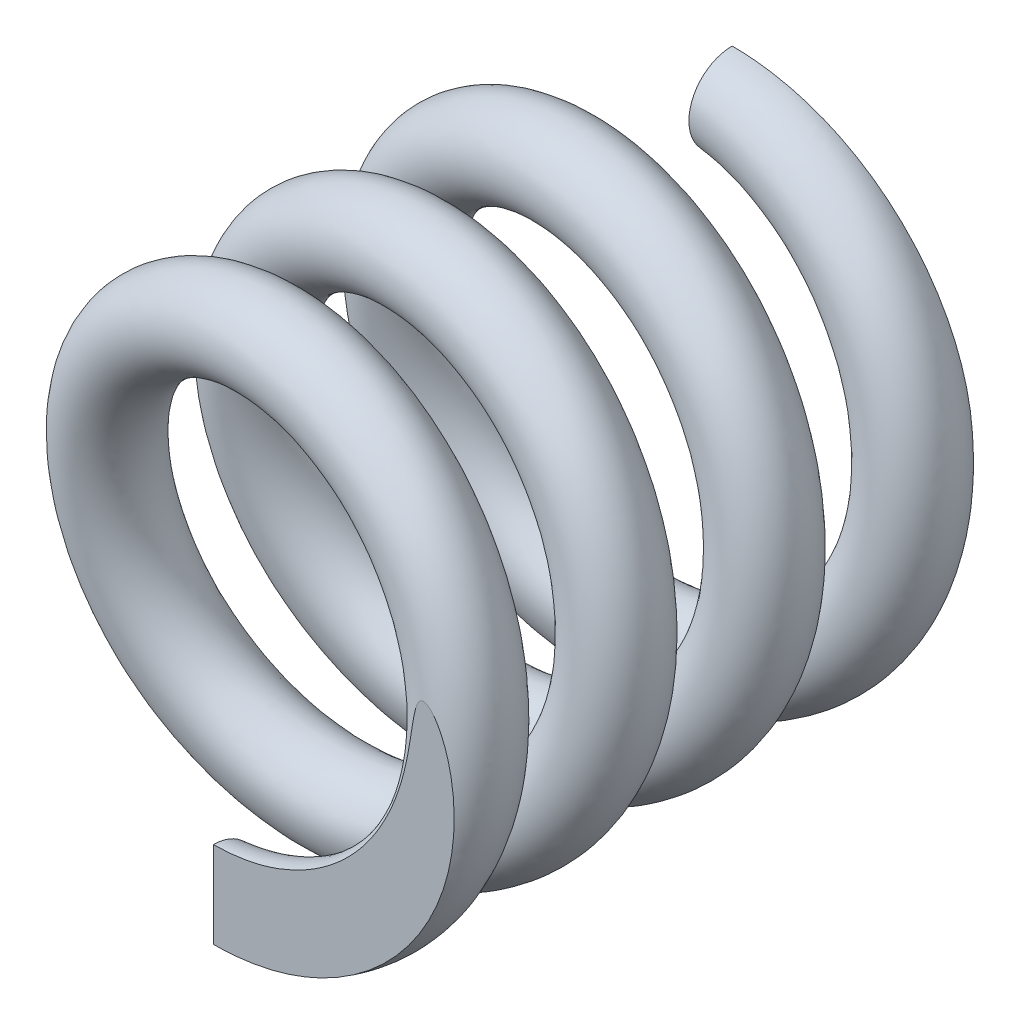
ISO-10303-21;
HEADER;
FILE_DESCRIPTION(('STEP AP214'),'2;1');
FILE_NAME('part.step','',(''),(''),'','','');
FILE_SCHEMA(('AUTOMOTIVE_DESIGN { 1 0 10303 214 1 1 1 1 }'));
ENDSEC;
DATA;
#1=APPLICATION_CONTEXT('core data for automotive mechanical design processes');
#2=APPLICATION_PROTOCOL_DEFINITION('international standard','automotive_design',2000,#1);
#3=PRODUCT_CONTEXT('',#1,'mechanical');
#4=PRODUCT('Part','Part','',(#3));
#5=PRODUCT_RELATED_PRODUCT_CATEGORY('part','',(#4));
#6=PRODUCT_DEFINITION_FORMATION('','',#4);
#7=PRODUCT_DEFINITION_CONTEXT('part definition',#1,'design');
#8=PRODUCT_DEFINITION('design','',#6,#7);
#9=PRODUCT_DEFINITION_SHAPE('','',#8);
#10=(LENGTH_UNIT() NAMED_UNIT(*) SI_UNIT(.MILLI.,.METRE.));
#11=(NAMED_UNIT(*) PLANE_ANGLE_UNIT() SI_UNIT($,.RADIAN.));
#12=(NAMED_UNIT(*) SI_UNIT($,.STERADIAN.) SOLID_ANGLE_UNIT());
#13=UNCERTAINTY_MEASURE_WITH_UNIT(LENGTH_MEASURE(1.E-05),#10,'distance_accuracy_value','');
#14=(GEOMETRIC_REPRESENTATION_CONTEXT(3) GLOBAL_UNCERTAINTY_ASSIGNED_CONTEXT((#13)) GLOBAL_UNIT_ASSIGNED_CONTEXT((#10,
#11,#12)) REPRESENTATION_CONTEXT('',''));
#15=CARTESIAN_POINT('',(0.,0.,0.));
#16=DIRECTION('',(0.,0.,1.));
#17=DIRECTION('',(1.,0.,0.));
#18=AXIS2_PLACEMENT_3D('',#15,#16,#17);
#19=CARTESIAN_POINT('',(0.,5.,1.));
#20=DIRECTION('',(-1.,0.,0.));
#21=DIRECTION('',(0.,0.,1.));
#22=AXIS2_PLACEMENT_3D('',#19,#20,#21);
#23=PLANE('',#22);
#24=CARTESIAN_POINT('',(0.,5.,0.));
#25=DIRECTION('',(1.,0.,0.));
#26=DIRECTION('',(0.,0.,-1.));
#27=AXIS2_PLACEMENT_3D('',#24,#25,#26);
#28=CIRCLE('',#27,1.);
#29=CARTESIAN_POINT('',(0.,6.,0.));
#30=VERTEX_POINT('',#29);
#31=CARTESIAN_POINT('',(2.08220397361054E-10,4.,-2.77528251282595E-11));
#32=VERTEX_POINT('',#31);
#33=EDGE_CURVE('E76',#30,#32,#28,.T.);
#34=ORIENTED_EDGE('',*,*,#33,.F.);
#35=DIRECTION('',(0.,-1.,0.));
#36=VECTOR('',#35,1.);
#37=CARTESIAN_POINT('',(0.,5.,0.));
#38=LINE('',#37,#36);
#39=EDGE_CURVE('E65',#30,#32,#38,.T.);
#40=ORIENTED_EDGE('',*,*,#39,.T.);
#41=EDGE_LOOP('',(#34,#40));
#42=FACE_BOUND('',#41,.T.);
#43=ADVANCED_FACE('F40',(#42),#23,.T.);
#44=CARTESIAN_POINT('',(0.,-5.,13.));
#45=DIRECTION('',(1.,0.,0.));
#46=DIRECTION('',(0.,1.,0.));
#47=AXIS2_PLACEMENT_3D('',#44,#45,#46);
#48=PLANE('',#47);
#49=DIRECTION('',(0.,-1.,0.));
#50=VECTOR('',#49,1.);
#51=CARTESIAN_POINT('',(0.,-5.,12.));
#52=LINE('',#51,#50);
#53=CARTESIAN_POINT('',(2.13929999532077E-10,-4.,12.));
#54=VERTEX_POINT('',#53);
#55=CARTESIAN_POINT('',(0.,-6.,12.));
#56=VERTEX_POINT('',#55);
#57=EDGE_CURVE('E59',#54,#56,#52,.T.);
#58=ORIENTED_EDGE('',*,*,#57,.F.);
#59=CARTESIAN_POINT('',(0.,-5.,12.));
#60=DIRECTION('',(-1.,0.,0.));
#61=DIRECTION('',(0.,0.,-1.));
#62=AXIS2_PLACEMENT_3D('',#59,#60,#61);
#63=CIRCLE('',#62,1.);
#64=EDGE_CURVE('E74',#56,#54,#63,.F.);
#65=ORIENTED_EDGE('',*,*,#64,.F.);
#66=EDGE_LOOP('',(#58,#65));
#67=FACE_BOUND('',#66,.T.);
#68=ADVANCED_FACE('F42',(#67),#48,.F.);
#69=CARTESIAN_POINT('',(0.,5.,-1.));
#70=CARTESIAN_POINT('',(1.33974596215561,5.,-0.857142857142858));
#71=CARTESIAN_POINT('',(2.5,4.3301270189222,-0.714285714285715));
#72=CARTESIAN_POINT('',(3.66025403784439,3.66025403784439,-0.571428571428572));
#73=CARTESIAN_POINT('',(4.33012701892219,2.5,-0.428571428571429));
#74=CARTESIAN_POINT('',(5.,1.33974596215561,-0.285714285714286));
#75=CARTESIAN_POINT('',(5.,0.,-0.142857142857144));
#76=CARTESIAN_POINT('',(5.,-1.33974596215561,0.));
#77=CARTESIAN_POINT('',(4.3301270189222,-2.5,0.142857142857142));
#78=CARTESIAN_POINT('',(3.66025403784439,-3.66025403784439,0.285714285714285));
#79=CARTESIAN_POINT('',(2.5,-4.33012701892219,0.428571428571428));
#80=CARTESIAN_POINT('',(1.33974596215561,-5.,0.571428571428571));
#81=CARTESIAN_POINT('',(0.,-5.,0.714285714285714));
#82=CARTESIAN_POINT('',(-1.33974596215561,-5.,0.857142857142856));
#83=CARTESIAN_POINT('',(-2.5,-4.3301270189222,0.999999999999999));
#84=CARTESIAN_POINT('',(-3.66025403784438,-3.66025403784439,1.14285714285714));
#85=CARTESIAN_POINT('',(-4.33012701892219,-2.5,1.28571428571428));
#86=CARTESIAN_POINT('',(-5.,-1.33974596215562,1.42857142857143));
#87=CARTESIAN_POINT('',(-5.,0.,1.57142857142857));
#88=CARTESIAN_POINT('',(-5.,1.33974596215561,1.71428571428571));
#89=CARTESIAN_POINT('',(-4.3301270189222,2.5,1.85714285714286));
#90=CARTESIAN_POINT('',(-3.66025403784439,3.66025403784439,2.));
#91=CARTESIAN_POINT('',(-2.5,4.33012701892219,2.14285714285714));
#92=CARTESIAN_POINT('',(-1.33974596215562,5.,2.28571428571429));
#93=CARTESIAN_POINT('',(0.,5.,2.42857142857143));
#94=CARTESIAN_POINT('',(1.33974596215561,5.,2.57142857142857));
#95=CARTESIAN_POINT('',(2.5,4.3301270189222,2.71428571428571));
#96=CARTESIAN_POINT('',(3.66025403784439,3.66025403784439,2.85714285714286));
#97=CARTESIAN_POINT('',(4.33012701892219,2.5,3.));
#98=CARTESIAN_POINT('',(5.,1.33974596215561,3.14285714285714));
#99=CARTESIAN_POINT('',(5.,0.,3.28571428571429));
#100=CARTESIAN_POINT('',(5.,-1.33974596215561,3.42857142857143));
#101=CARTESIAN_POINT('',(4.3301270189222,-2.5,3.57142857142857));
#102=CARTESIAN_POINT('',(3.66025403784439,-3.66025403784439,3.71428571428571));
#103=CARTESIAN_POINT('',(2.5,-4.33012701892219,3.85714285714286));
#104=CARTESIAN_POINT('',(1.33974596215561,-5.,4.));
#105=CARTESIAN_POINT('',(0.,-5.,4.14285714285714));
#106=CARTESIAN_POINT('',(-1.33974596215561,-5.,4.28571428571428));
#107=CARTESIAN_POINT('',(-2.5,-4.3301270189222,4.42857142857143));
#108=CARTESIAN_POINT('',(-3.66025403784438,-3.66025403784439,4.57142857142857));
#109=CARTESIAN_POINT('',(-4.33012701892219,-2.5,4.71428571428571));
#110=CARTESIAN_POINT('',(-5.,-1.33974596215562,4.85714285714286));
#111=CARTESIAN_POINT('',(-5.,0.,5.));
#112=CARTESIAN_POINT('',(-5.,1.33974596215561,5.14285714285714));
#113=CARTESIAN_POINT('',(-4.3301270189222,2.5,5.28571428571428));
#114=CARTESIAN_POINT('',(-3.66025403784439,3.66025403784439,5.42857142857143));
#115=CARTESIAN_POINT('',(-2.5,4.33012701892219,5.57142857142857));
#116=CARTESIAN_POINT('',(-1.33974596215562,5.,5.71428571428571));
#117=CARTESIAN_POINT('',(0.,5.,5.85714285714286));
#118=CARTESIAN_POINT('',(1.33974596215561,5.,6.));
#119=CARTESIAN_POINT('',(2.5,4.3301270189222,6.14285714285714));
#120=CARTESIAN_POINT('',(3.66025403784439,3.66025403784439,6.28571428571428));
#121=CARTESIAN_POINT('',(4.33012701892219,2.5,6.42857142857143));
#122=CARTESIAN_POINT('',(5.,1.33974596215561,6.57142857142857));
#123=CARTESIAN_POINT('',(5.,0.,6.71428571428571));
#124=CARTESIAN_POINT('',(5.,-1.33974596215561,6.85714285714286));
#125=CARTESIAN_POINT('',(4.3301270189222,-2.5,7.));
#126=CARTESIAN_POINT('',(3.66025403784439,-3.66025403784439,7.14285714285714));
#127=CARTESIAN_POINT('',(2.5,-4.33012701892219,7.28571428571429));
#128=CARTESIAN_POINT('',(1.33974596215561,-5.,7.42857142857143));
#129=CARTESIAN_POINT('',(0.,-5.,7.57142857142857));
#130=CARTESIAN_POINT('',(-1.33974596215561,-5.,7.71428571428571));
#131=CARTESIAN_POINT('',(-2.5,-4.3301270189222,7.85714285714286));
#132=CARTESIAN_POINT('',(-3.66025403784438,-3.66025403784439,8.));
#133=CARTESIAN_POINT('',(-4.33012701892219,-2.5,8.14285714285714));
#134=CARTESIAN_POINT('',(-5.,-1.33974596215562,8.28571428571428));
#135=CARTESIAN_POINT('',(-5.,0.,8.42857142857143));
#136=CARTESIAN_POINT('',(-5.,1.33974596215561,8.57142857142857));
#137=CARTESIAN_POINT('',(-4.3301270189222,2.5,8.71428571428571));
#138=CARTESIAN_POINT('',(-3.66025403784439,3.66025403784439,8.85714285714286));
#139=CARTESIAN_POINT('',(-2.5,4.33012701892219,9.));
#140=CARTESIAN_POINT('',(-1.33974596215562,5.,9.14285714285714));
#141=CARTESIAN_POINT('',(0.,5.,9.28571428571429));
#142=CARTESIAN_POINT('',(1.33974596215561,5.,9.42857142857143));
#143=CARTESIAN_POINT('',(2.5,4.3301270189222,9.57142857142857));
#144=CARTESIAN_POINT('',(3.66025403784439,3.66025403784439,9.71428571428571));
#145=CARTESIAN_POINT('',(4.33012701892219,2.5,9.85714285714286));
#146=CARTESIAN_POINT('',(5.,1.33974596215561,10.));
#147=CARTESIAN_POINT('',(5.,0.,10.1428571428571));
#148=CARTESIAN_POINT('',(5.,-1.33974596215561,10.2857142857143));
#149=CARTESIAN_POINT('',(4.3301270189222,-2.5,10.4285714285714));
#150=CARTESIAN_POINT('',(3.66025403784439,-3.66025403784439,10.5714285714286));
#151=CARTESIAN_POINT('',(2.5,-4.33012701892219,10.7142857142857));
#152=CARTESIAN_POINT('',(1.33974596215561,-5.,10.8571428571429));
#153=CARTESIAN_POINT('',(0.,-5.,11.));
#154=CARTESIAN_POINT('',(0.,5.26158318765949,-1.));
#155=CARTESIAN_POINT('',(1.40983696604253,5.26158318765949,-0.857142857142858));
#156=CARTESIAN_POINT('',(2.63079159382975,4.55666470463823,-0.714285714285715));
#157=CARTESIAN_POINT('',(3.85174622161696,3.85174622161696,-0.571428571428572));
#158=CARTESIAN_POINT('',(4.55666470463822,2.63079159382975,-0.428571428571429));
#159=CARTESIAN_POINT('',(5.26158318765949,1.40983696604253,-0.285714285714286));
#160=CARTESIAN_POINT('',(5.26158318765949,0.,-0.142857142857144));
#161=CARTESIAN_POINT('',(5.26158318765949,-1.40983696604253,0.));
#162=CARTESIAN_POINT('',(4.55666470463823,-2.63079159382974,0.142857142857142));
#163=CARTESIAN_POINT('',(3.85174622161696,-3.85174622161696,0.285714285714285));
#164=CARTESIAN_POINT('',(2.63079159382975,-4.55666470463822,0.428571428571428));
#165=CARTESIAN_POINT('',(1.40983696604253,-5.26158318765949,0.571428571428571));
#166=CARTESIAN_POINT('',(0.,-5.26158318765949,0.714285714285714));
#167=CARTESIAN_POINT('',(-1.40983696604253,-5.26158318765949,0.857142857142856));
#168=CARTESIAN_POINT('',(-2.63079159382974,-4.55666470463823,0.999999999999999));
#169=CARTESIAN_POINT('',(-3.85174622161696,-3.85174622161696,1.14285714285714));
#170=CARTESIAN_POINT('',(-4.55666470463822,-2.63079159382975,1.28571428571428));
#171=CARTESIAN_POINT('',(-5.26158318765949,-1.40983696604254,1.42857142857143));
#172=CARTESIAN_POINT('',(-5.26158318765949,0.,1.57142857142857));
#173=CARTESIAN_POINT('',(-5.26158318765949,1.40983696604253,1.71428571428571));
#174=CARTESIAN_POINT('',(-4.55666470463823,2.63079159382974,1.85714285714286));
#175=CARTESIAN_POINT('',(-3.85174622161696,3.85174622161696,2.));
#176=CARTESIAN_POINT('',(-2.63079159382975,4.55666470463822,2.14285714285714));
#177=CARTESIAN_POINT('',(-1.40983696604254,5.26158318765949,2.28571428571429));
#178=CARTESIAN_POINT('',(0.,5.26158318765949,2.42857142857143));
#179=CARTESIAN_POINT('',(1.40983696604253,5.26158318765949,2.57142857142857));
#180=CARTESIAN_POINT('',(2.63079159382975,4.55666470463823,2.71428571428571));
#181=CARTESIAN_POINT('',(3.85174622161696,3.85174622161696,2.85714285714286));
#182=CARTESIAN_POINT('',(4.55666470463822,2.63079159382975,3.));
#183=CARTESIAN_POINT('',(5.26158318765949,1.40983696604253,3.14285714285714));
#184=CARTESIAN_POINT('',(5.26158318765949,0.,3.28571428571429));
#185=CARTESIAN_POINT('',(5.26158318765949,-1.40983696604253,3.42857142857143));
#186=CARTESIAN_POINT('',(4.55666470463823,-2.63079159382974,3.57142857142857));
#187=CARTESIAN_POINT('',(3.85174622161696,-3.85174622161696,3.71428571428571));
#188=CARTESIAN_POINT('',(2.63079159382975,-4.55666470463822,3.85714285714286));
#189=CARTESIAN_POINT('',(1.40983696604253,-5.26158318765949,4.));
#190=CARTESIAN_POINT('',(0.,-5.26158318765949,4.14285714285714));
#191=CARTESIAN_POINT('',(-1.40983696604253,-5.26158318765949,4.28571428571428));
#192=CARTESIAN_POINT('',(-2.63079159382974,-4.55666470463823,4.42857142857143));
#193=CARTESIAN_POINT('',(-3.85174622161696,-3.85174622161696,4.57142857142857));
#194=CARTESIAN_POINT('',(-4.55666470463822,-2.63079159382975,4.71428571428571));
#195=CARTESIAN_POINT('',(-5.26158318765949,-1.40983696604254,4.85714285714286));
#196=CARTESIAN_POINT('',(-5.26158318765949,0.,5.));
#197=CARTESIAN_POINT('',(-5.26158318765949,1.40983696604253,5.14285714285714));
#198=CARTESIAN_POINT('',(-4.55666470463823,2.63079159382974,5.28571428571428));
#199=CARTESIAN_POINT('',(-3.85174622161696,3.85174622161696,5.42857142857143));
#200=CARTESIAN_POINT('',(-2.63079159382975,4.55666470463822,5.57142857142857));
#201=CARTESIAN_POINT('',(-1.40983696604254,5.26158318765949,5.71428571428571));
#202=CARTESIAN_POINT('',(0.,5.26158318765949,5.85714285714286));
#203=CARTESIAN_POINT('',(1.40983696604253,5.26158318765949,6.));
#204=CARTESIAN_POINT('',(2.63079159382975,4.55666470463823,6.14285714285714));
#205=CARTESIAN_POINT('',(3.85174622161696,3.85174622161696,6.28571428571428));
#206=CARTESIAN_POINT('',(4.55666470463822,2.63079159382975,6.42857142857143));
#207=CARTESIAN_POINT('',(5.26158318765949,1.40983696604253,6.57142857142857));
#208=CARTESIAN_POINT('',(5.26158318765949,0.,6.71428571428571));
#209=CARTESIAN_POINT('',(5.26158318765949,-1.40983696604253,6.85714285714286));
#210=CARTESIAN_POINT('',(4.55666470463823,-2.63079159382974,7.));
#211=CARTESIAN_POINT('',(3.85174622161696,-3.85174622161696,7.14285714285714));
#212=CARTESIAN_POINT('',(2.63079159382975,-4.55666470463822,7.28571428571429));
#213=CARTESIAN_POINT('',(1.40983696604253,-5.26158318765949,7.42857142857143));
#214=CARTESIAN_POINT('',(0.,-5.26158318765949,7.57142857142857));
#215=CARTESIAN_POINT('',(-1.40983696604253,-5.26158318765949,7.71428571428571));
#216=CARTESIAN_POINT('',(-2.63079159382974,-4.55666470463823,7.85714285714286));
#217=CARTESIAN_POINT('',(-3.85174622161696,-3.85174622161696,8.));
#218=CARTESIAN_POINT('',(-4.55666470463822,-2.63079159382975,8.14285714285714));
#219=CARTESIAN_POINT('',(-5.26158318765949,-1.40983696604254,8.28571428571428));
#220=CARTESIAN_POINT('',(-5.26158318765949,0.,8.42857142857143));
#221=CARTESIAN_POINT('',(-5.26158318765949,1.40983696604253,8.57142857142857));
#222=CARTESIAN_POINT('',(-4.55666470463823,2.63079159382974,8.71428571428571));
#223=CARTESIAN_POINT('',(-3.85174622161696,3.85174622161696,8.85714285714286));
#224=CARTESIAN_POINT('',(-2.63079159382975,4.55666470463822,9.));
#225=CARTESIAN_POINT('',(-1.40983696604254,5.26158318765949,9.14285714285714));
#226=CARTESIAN_POINT('',(0.,5.26158318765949,9.28571428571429));
#227=CARTESIAN_POINT('',(1.40983696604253,5.26158318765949,9.42857142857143));
#228=CARTESIAN_POINT('',(2.63079159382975,4.55666470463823,9.57142857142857));
#229=CARTESIAN_POINT('',(3.85174622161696,3.85174622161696,9.71428571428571));
#230=CARTESIAN_POINT('',(4.55666470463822,2.63079159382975,9.85714285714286));
#231=CARTESIAN_POINT('',(5.26158318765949,1.40983696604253,10.));
#232=CARTESIAN_POINT('',(5.26158318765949,0.,10.1428571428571));
#233=CARTESIAN_POINT('',(5.26158318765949,-1.40983696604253,10.2857142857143));
#234=CARTESIAN_POINT('',(4.55666470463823,-2.63079159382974,10.4285714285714));
#235=CARTESIAN_POINT('',(3.85174622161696,-3.85174622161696,10.5714285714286));
#236=CARTESIAN_POINT('',(2.63079159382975,-4.55666470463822,10.7142857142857));
#237=CARTESIAN_POINT('',(1.40983696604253,-5.26158318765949,10.8571428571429));
#238=CARTESIAN_POINT('',(0.,-5.26158318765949,11.));
#239=CARTESIAN_POINT('',(0.,6.,-0.849527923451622));
#240=CARTESIAN_POINT('',(1.60769515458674,6.,-0.706670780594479));
#241=CARTESIAN_POINT('',(3.,5.19615242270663,-0.563813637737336));
#242=CARTESIAN_POINT('',(4.39230484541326,4.39230484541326,-0.420956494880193));
#243=CARTESIAN_POINT('',(5.19615242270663,3.,-0.27809935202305));
#244=CARTESIAN_POINT('',(6.,1.60769515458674,-0.135242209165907));
#245=CARTESIAN_POINT('',(6.,0.,0.00761493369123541));
#246=CARTESIAN_POINT('',(6.,-1.60769515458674,0.150472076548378));
#247=CARTESIAN_POINT('',(5.19615242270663,-3.,0.293329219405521));
#248=CARTESIAN_POINT('',(4.39230484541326,-4.39230484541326,0.436186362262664));
#249=CARTESIAN_POINT('',(3.,-5.19615242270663,0.579043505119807));
#250=CARTESIAN_POINT('',(1.60769515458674,-6.,0.72190064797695));
#251=CARTESIAN_POINT('',(0.,-6.,0.864757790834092));
#252=CARTESIAN_POINT('',(-1.60769515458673,-6.,1.00761493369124));
#253=CARTESIAN_POINT('',(-3.,-5.19615242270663,1.15047207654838));
#254=CARTESIAN_POINT('',(-4.39230484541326,-4.39230484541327,1.29332921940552));
#255=CARTESIAN_POINT('',(-5.19615242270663,-3.,1.43618636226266));
#256=CARTESIAN_POINT('',(-6.,-1.60769515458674,1.57904350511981));
#257=CARTESIAN_POINT('',(-6.,0.,1.72190064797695));
#258=CARTESIAN_POINT('',(-6.,1.60769515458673,1.86475779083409));
#259=CARTESIAN_POINT('',(-5.19615242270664,3.,2.00761493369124));
#260=CARTESIAN_POINT('',(-4.39230484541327,4.39230484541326,2.15047207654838));
#261=CARTESIAN_POINT('',(-3.,5.19615242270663,2.29332921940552));
#262=CARTESIAN_POINT('',(-1.60769515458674,6.,2.43618636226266));
#263=CARTESIAN_POINT('',(0.,6.,2.57904350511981));
#264=CARTESIAN_POINT('',(1.60769515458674,6.,2.72190064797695));
#265=CARTESIAN_POINT('',(3.,5.19615242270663,2.86475779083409));
#266=CARTESIAN_POINT('',(4.39230484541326,4.39230484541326,3.00761493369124));
#267=CARTESIAN_POINT('',(5.19615242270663,3.,3.15047207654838));
#268=CARTESIAN_POINT('',(6.,1.60769515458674,3.29332921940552));
#269=CARTESIAN_POINT('',(6.,0.,3.43618636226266));
#270=CARTESIAN_POINT('',(6.,-1.60769515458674,3.57904350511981));
#271=CARTESIAN_POINT('',(5.19615242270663,-3.,3.72190064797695));
#272=CARTESIAN_POINT('',(4.39230484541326,-4.39230484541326,3.86475779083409));
#273=CARTESIAN_POINT('',(3.,-5.19615242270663,4.00761493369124));
#274=CARTESIAN_POINT('',(1.60769515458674,-6.,4.15047207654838));
#275=CARTESIAN_POINT('',(0.,-6.,4.29332921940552));
#276=CARTESIAN_POINT('',(-1.60769515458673,-6.,4.43618636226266));
#277=CARTESIAN_POINT('',(-3.,-5.19615242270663,4.57904350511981));
#278=CARTESIAN_POINT('',(-4.39230484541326,-4.39230484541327,4.72190064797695));
#279=CARTESIAN_POINT('',(-5.19615242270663,-3.,4.86475779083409));
#280=CARTESIAN_POINT('',(-6.,-1.60769515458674,5.00761493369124));
#281=CARTESIAN_POINT('',(-6.,0.,5.15047207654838));
#282=CARTESIAN_POINT('',(-6.,1.60769515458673,5.29332921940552));
#283=CARTESIAN_POINT('',(-5.19615242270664,3.,5.43618636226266));
#284=CARTESIAN_POINT('',(-4.39230484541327,4.39230484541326,5.57904350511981));
#285=CARTESIAN_POINT('',(-3.,5.19615242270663,5.72190064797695));
#286=CARTESIAN_POINT('',(-1.60769515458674,6.,5.86475779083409));
#287=CARTESIAN_POINT('',(0.,6.,6.00761493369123));
#288=CARTESIAN_POINT('',(1.60769515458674,6.,6.15047207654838));
#289=CARTESIAN_POINT('',(3.,5.19615242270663,6.29332921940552));
#290=CARTESIAN_POINT('',(4.39230484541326,4.39230484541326,6.43618636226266));
#291=CARTESIAN_POINT('',(5.19615242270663,3.,6.57904350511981));
#292=CARTESIAN_POINT('',(6.,1.60769515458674,6.72190064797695));
#293=CARTESIAN_POINT('',(6.,0.,6.86475779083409));
#294=CARTESIAN_POINT('',(6.,-1.60769515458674,7.00761493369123));
#295=CARTESIAN_POINT('',(5.19615242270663,-3.,7.15047207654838));
#296=CARTESIAN_POINT('',(4.39230484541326,-4.39230484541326,7.29332921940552));
#297=CARTESIAN_POINT('',(3.,-5.19615242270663,7.43618636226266));
#298=CARTESIAN_POINT('',(1.60769515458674,-6.,7.57904350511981));
#299=CARTESIAN_POINT('',(0.,-6.,7.72190064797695));
#300=CARTESIAN_POINT('',(-1.60769515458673,-6.,7.86475779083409));
#301=CARTESIAN_POINT('',(-3.,-5.19615242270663,8.00761493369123));
#302=CARTESIAN_POINT('',(-4.39230484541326,-4.39230484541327,8.15047207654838));
#303=CARTESIAN_POINT('',(-5.19615242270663,-3.,8.29332921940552));
#304=CARTESIAN_POINT('',(-6.,-1.60769515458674,8.43618636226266));
#305=CARTESIAN_POINT('',(-6.,0.,8.57904350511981));
#306=CARTESIAN_POINT('',(-6.,1.60769515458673,8.72190064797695));
#307=CARTESIAN_POINT('',(-5.19615242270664,3.,8.86475779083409));
#308=CARTESIAN_POINT('',(-4.39230484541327,4.39230484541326,9.00761493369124));
#309=CARTESIAN_POINT('',(-3.,5.19615242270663,9.15047207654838));
#310=CARTESIAN_POINT('',(-1.60769515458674,6.,9.29332921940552));
#311=CARTESIAN_POINT('',(0.,6.,9.43618636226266));
#312=CARTESIAN_POINT('',(1.60769515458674,6.,9.57904350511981));
#313=CARTESIAN_POINT('',(3.,5.19615242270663,9.72190064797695));
#314=CARTESIAN_POINT('',(4.39230484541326,4.39230484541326,9.86475779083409));
#315=CARTESIAN_POINT('',(5.19615242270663,3.,10.0076149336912));
#316=CARTESIAN_POINT('',(6.,1.60769515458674,10.1504720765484));
#317=CARTESIAN_POINT('',(6.,0.,10.2933292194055));
#318=CARTESIAN_POINT('',(6.,-1.60769515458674,10.4361863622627));
#319=CARTESIAN_POINT('',(5.19615242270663,-3.,10.5790435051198));
#320=CARTESIAN_POINT('',(4.39230484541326,-4.39230484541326,10.721900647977));
#321=CARTESIAN_POINT('',(3.,-5.19615242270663,10.8647577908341));
#322=CARTESIAN_POINT('',(1.60769515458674,-6.,11.0076149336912));
#323=CARTESIAN_POINT('',(0.,-6.,11.1504720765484));
#324=CARTESIAN_POINT('',(0.,6.,0.849527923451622));
#325=CARTESIAN_POINT('',(1.60769515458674,6.,0.992385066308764));
#326=CARTESIAN_POINT('',(3.,5.19615242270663,1.13524220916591));
#327=CARTESIAN_POINT('',(4.39230484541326,4.39230484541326,1.27809935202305));
#328=CARTESIAN_POINT('',(5.19615242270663,3.,1.42095649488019));
#329=CARTESIAN_POINT('',(6.,1.60769515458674,1.56381363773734));
#330=CARTESIAN_POINT('',(6.,0.,1.70667078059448));
#331=CARTESIAN_POINT('',(6.,-1.60769515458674,1.84952792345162));
#332=CARTESIAN_POINT('',(5.19615242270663,-3.,1.99238506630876));
#333=CARTESIAN_POINT('',(4.39230484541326,-4.39230484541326,2.13524220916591));
#334=CARTESIAN_POINT('',(3.,-5.19615242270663,2.27809935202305));
#335=CARTESIAN_POINT('',(1.60769515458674,-6.,2.42095649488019));
#336=CARTESIAN_POINT('',(0.,-6.,2.56381363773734));
#337=CARTESIAN_POINT('',(-1.60769515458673,-6.,2.70667078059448));
#338=CARTESIAN_POINT('',(-3.,-5.19615242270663,2.84952792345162));
#339=CARTESIAN_POINT('',(-4.39230484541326,-4.39230484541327,2.99238506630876));
#340=CARTESIAN_POINT('',(-5.19615242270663,-3.,3.13524220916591));
#341=CARTESIAN_POINT('',(-6.,-1.60769515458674,3.27809935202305));
#342=CARTESIAN_POINT('',(-6.,0.,3.42095649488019));
#343=CARTESIAN_POINT('',(-6.,1.60769515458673,3.56381363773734));
#344=CARTESIAN_POINT('',(-5.19615242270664,3.,3.70667078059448));
#345=CARTESIAN_POINT('',(-4.39230484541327,4.39230484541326,3.84952792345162));
#346=CARTESIAN_POINT('',(-3.,5.19615242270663,3.99238506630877));
#347=CARTESIAN_POINT('',(-1.60769515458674,6.,4.13524220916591));
#348=CARTESIAN_POINT('',(0.,6.,4.27809935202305));
#349=CARTESIAN_POINT('',(1.60769515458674,6.,4.42095649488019));
#350=CARTESIAN_POINT('',(3.,5.19615242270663,4.56381363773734));
#351=CARTESIAN_POINT('',(4.39230484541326,4.39230484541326,4.70667078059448));
#352=CARTESIAN_POINT('',(5.19615242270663,3.,4.84952792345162));
#353=CARTESIAN_POINT('',(6.,1.60769515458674,4.99238506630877));
#354=CARTESIAN_POINT('',(6.,0.,5.13524220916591));
#355=CARTESIAN_POINT('',(6.,-1.60769515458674,5.27809935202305));
#356=CARTESIAN_POINT('',(5.19615242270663,-3.,5.42095649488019));
#357=CARTESIAN_POINT('',(4.39230484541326,-4.39230484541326,5.56381363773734));
#358=CARTESIAN_POINT('',(3.,-5.19615242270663,5.70667078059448));
#359=CARTESIAN_POINT('',(1.60769515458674,-6.,5.84952792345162));
#360=CARTESIAN_POINT('',(0.,-6.,5.99238506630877));
#361=CARTESIAN_POINT('',(-1.60769515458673,-6.,6.13524220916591));
#362=CARTESIAN_POINT('',(-3.,-5.19615242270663,6.27809935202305));
#363=CARTESIAN_POINT('',(-4.39230484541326,-4.39230484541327,6.42095649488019));
#364=CARTESIAN_POINT('',(-5.19615242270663,-3.,6.56381363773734));
#365=CARTESIAN_POINT('',(-6.,-1.60769515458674,6.70667078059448));
#366=CARTESIAN_POINT('',(-6.,0.,6.84952792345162));
#367=CARTESIAN_POINT('',(-6.,1.60769515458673,6.99238506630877));
#368=CARTESIAN_POINT('',(-5.19615242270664,3.,7.13524220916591));
#369=CARTESIAN_POINT('',(-4.39230484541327,4.39230484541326,7.27809935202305));
#370=CARTESIAN_POINT('',(-3.,5.19615242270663,7.42095649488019));
#371=CARTESIAN_POINT('',(-1.60769515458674,6.,7.56381363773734));
#372=CARTESIAN_POINT('',(0.,6.,7.70667078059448));
#373=CARTESIAN_POINT('',(1.60769515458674,6.,7.84952792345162));
#374=CARTESIAN_POINT('',(3.,5.19615242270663,7.99238506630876));
#375=CARTESIAN_POINT('',(4.39230484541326,4.39230484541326,8.13524220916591));
#376=CARTESIAN_POINT('',(5.19615242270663,3.,8.27809935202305));
#377=CARTESIAN_POINT('',(6.,1.60769515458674,8.42095649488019));
#378=CARTESIAN_POINT('',(6.,0.,8.56381363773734));
#379=CARTESIAN_POINT('',(6.,-1.60769515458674,8.70667078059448));
#380=CARTESIAN_POINT('',(5.19615242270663,-3.,8.84952792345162));
#381=CARTESIAN_POINT('',(4.39230484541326,-4.39230484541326,8.99238506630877));
#382=CARTESIAN_POINT('',(3.,-5.19615242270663,9.13524220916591));
#383=CARTESIAN_POINT('',(1.60769515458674,-6.,9.27809935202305));
#384=CARTESIAN_POINT('',(0.,-6.,9.42095649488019));
#385=CARTESIAN_POINT('',(-1.60769515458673,-6.,9.56381363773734));
#386=CARTESIAN_POINT('',(-3.,-5.19615242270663,9.70667078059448));
#387=CARTESIAN_POINT('',(-4.39230484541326,-4.39230484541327,9.84952792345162));
#388=CARTESIAN_POINT('',(-5.19615242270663,-3.,9.99238506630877));
#389=CARTESIAN_POINT('',(-6.,-1.60769515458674,10.1352422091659));
#390=CARTESIAN_POINT('',(-6.,0.,10.278099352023));
#391=CARTESIAN_POINT('',(-6.,1.60769515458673,10.4209564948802));
#392=CARTESIAN_POINT('',(-5.19615242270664,3.,10.5638136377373));
#393=CARTESIAN_POINT('',(-4.39230484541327,4.39230484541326,10.7066707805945));
#394=CARTESIAN_POINT('',(-3.,5.19615242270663,10.8495279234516));
#395=CARTESIAN_POINT('',(-1.60769515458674,6.,10.9923850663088));
#396=CARTESIAN_POINT('',(0.,6.,11.1352422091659));
#397=CARTESIAN_POINT('',(1.60769515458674,6.,11.2780993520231));
#398=CARTESIAN_POINT('',(3.,5.19615242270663,11.4209564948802));
#399=CARTESIAN_POINT('',(4.39230484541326,4.39230484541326,11.5638136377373));
#400=CARTESIAN_POINT('',(5.19615242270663,3.,11.7066707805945));
#401=CARTESIAN_POINT('',(6.,1.60769515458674,11.8495279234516));
#402=CARTESIAN_POINT('',(6.,0.,11.9923850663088));
#403=CARTESIAN_POINT('',(6.,-1.60769515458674,12.1352422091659));
#404=CARTESIAN_POINT('',(5.19615242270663,-3.,12.2780993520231));
#405=CARTESIAN_POINT('',(4.39230484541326,-4.39230484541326,12.4209564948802));
#406=CARTESIAN_POINT('',(3.,-5.19615242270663,12.5638136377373));
#407=CARTESIAN_POINT('',(1.60769515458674,-6.,12.7066707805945));
#408=CARTESIAN_POINT('',(0.,-6.,12.8495279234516));
#409=CARTESIAN_POINT('',(0.,5.26158318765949,1.));
#410=CARTESIAN_POINT('',(1.40983696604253,5.26158318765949,1.14285714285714));
#411=CARTESIAN_POINT('',(2.63079159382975,4.55666470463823,1.28571428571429));
#412=CARTESIAN_POINT('',(3.85174622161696,3.85174622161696,1.42857142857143));
#413=CARTESIAN_POINT('',(4.55666470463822,2.63079159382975,1.57142857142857));
#414=CARTESIAN_POINT('',(5.26158318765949,1.40983696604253,1.71428571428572));
#415=CARTESIAN_POINT('',(5.26158318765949,0.,1.85714285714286));
#416=CARTESIAN_POINT('',(5.26158318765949,-1.40983696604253,2.));
#417=CARTESIAN_POINT('',(4.55666470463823,-2.63079159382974,2.14285714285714));
#418=CARTESIAN_POINT('',(3.85174622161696,-3.85174622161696,2.28571428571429));
#419=CARTESIAN_POINT('',(2.63079159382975,-4.55666470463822,2.42857142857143));
#420=CARTESIAN_POINT('',(1.40983696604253,-5.26158318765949,2.57142857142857));
#421=CARTESIAN_POINT('',(0.,-5.26158318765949,2.71428571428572));
#422=CARTESIAN_POINT('',(-1.40983696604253,-5.26158318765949,2.85714285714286));
#423=CARTESIAN_POINT('',(-2.63079159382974,-4.55666470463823,3.));
#424=CARTESIAN_POINT('',(-3.85174622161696,-3.85174622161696,3.14285714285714));
#425=CARTESIAN_POINT('',(-4.55666470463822,-2.63079159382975,3.28571428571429));
#426=CARTESIAN_POINT('',(-5.26158318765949,-1.40983696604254,3.42857142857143));
#427=CARTESIAN_POINT('',(-5.26158318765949,0.,3.57142857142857));
#428=CARTESIAN_POINT('',(-5.26158318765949,1.40983696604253,3.71428571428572));
#429=CARTESIAN_POINT('',(-4.55666470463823,2.63079159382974,3.85714285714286));
#430=CARTESIAN_POINT('',(-3.85174622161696,3.85174622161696,4.));
#431=CARTESIAN_POINT('',(-2.63079159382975,4.55666470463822,4.14285714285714));
#432=CARTESIAN_POINT('',(-1.40983696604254,5.26158318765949,4.28571428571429));
#433=CARTESIAN_POINT('',(0.,5.26158318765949,4.42857142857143));
#434=CARTESIAN_POINT('',(1.40983696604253,5.26158318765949,4.57142857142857));
#435=CARTESIAN_POINT('',(2.63079159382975,4.55666470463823,4.71428571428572));
#436=CARTESIAN_POINT('',(3.85174622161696,3.85174622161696,4.85714285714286));
#437=CARTESIAN_POINT('',(4.55666470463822,2.63079159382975,5.));
#438=CARTESIAN_POINT('',(5.26158318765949,1.40983696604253,5.14285714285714));
#439=CARTESIAN_POINT('',(5.26158318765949,0.,5.28571428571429));
#440=CARTESIAN_POINT('',(5.26158318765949,-1.40983696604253,5.42857142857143));
#441=CARTESIAN_POINT('',(4.55666470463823,-2.63079159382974,5.57142857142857));
#442=CARTESIAN_POINT('',(3.85174622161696,-3.85174622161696,5.71428571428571));
#443=CARTESIAN_POINT('',(2.63079159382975,-4.55666470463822,5.85714285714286));
#444=CARTESIAN_POINT('',(1.40983696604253,-5.26158318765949,6.));
#445=CARTESIAN_POINT('',(0.,-5.26158318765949,6.14285714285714));
#446=CARTESIAN_POINT('',(-1.40983696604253,-5.26158318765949,6.28571428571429));
#447=CARTESIAN_POINT('',(-2.63079159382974,-4.55666470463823,6.42857142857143));
#448=CARTESIAN_POINT('',(-3.85174622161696,-3.85174622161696,6.57142857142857));
#449=CARTESIAN_POINT('',(-4.55666470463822,-2.63079159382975,6.71428571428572));
#450=CARTESIAN_POINT('',(-5.26158318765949,-1.40983696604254,6.85714285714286));
#451=CARTESIAN_POINT('',(-5.26158318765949,0.,7.));
#452=CARTESIAN_POINT('',(-5.26158318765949,1.40983696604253,7.14285714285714));
#453=CARTESIAN_POINT('',(-4.55666470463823,2.63079159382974,7.28571428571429));
#454=CARTESIAN_POINT('',(-3.85174622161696,3.85174622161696,7.42857142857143));
#455=CARTESIAN_POINT('',(-2.63079159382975,4.55666470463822,7.57142857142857));
#456=CARTESIAN_POINT('',(-1.40983696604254,5.26158318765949,7.71428571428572));
#457=CARTESIAN_POINT('',(0.,5.26158318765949,7.85714285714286));
#458=CARTESIAN_POINT('',(1.40983696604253,5.26158318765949,8.));
#459=CARTESIAN_POINT('',(2.63079159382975,4.55666470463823,8.14285714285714));
#460=CARTESIAN_POINT('',(3.85174622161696,3.85174622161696,8.28571428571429));
#461=CARTESIAN_POINT('',(4.55666470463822,2.63079159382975,8.42857142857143));
#462=CARTESIAN_POINT('',(5.26158318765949,1.40983696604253,8.57142857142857));
#463=CARTESIAN_POINT('',(5.26158318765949,0.,8.71428571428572));
#464=CARTESIAN_POINT('',(5.26158318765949,-1.40983696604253,8.85714285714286));
#465=CARTESIAN_POINT('',(4.55666470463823,-2.63079159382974,9.));
#466=CARTESIAN_POINT('',(3.85174622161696,-3.85174622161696,9.14285714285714));
#467=CARTESIAN_POINT('',(2.63079159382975,-4.55666470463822,9.28571428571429));
#468=CARTESIAN_POINT('',(1.40983696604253,-5.26158318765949,9.42857142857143));
#469=CARTESIAN_POINT('',(0.,-5.26158318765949,9.57142857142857));
#470=CARTESIAN_POINT('',(-1.40983696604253,-5.26158318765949,9.71428571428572));
#471=CARTESIAN_POINT('',(-2.63079159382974,-4.55666470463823,9.85714285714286));
#472=CARTESIAN_POINT('',(-3.85174622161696,-3.85174622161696,10.));
#473=CARTESIAN_POINT('',(-4.55666470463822,-2.63079159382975,10.1428571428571));
#474=CARTESIAN_POINT('',(-5.26158318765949,-1.40983696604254,10.2857142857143));
#475=CARTESIAN_POINT('',(-5.26158318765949,0.,10.4285714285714));
#476=CARTESIAN_POINT('',(-5.26158318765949,1.40983696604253,10.5714285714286));
#477=CARTESIAN_POINT('',(-4.55666470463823,2.63079159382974,10.7142857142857));
#478=CARTESIAN_POINT('',(-3.85174622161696,3.85174622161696,10.8571428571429));
#479=CARTESIAN_POINT('',(-2.63079159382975,4.55666470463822,11.));
#480=CARTESIAN_POINT('',(-1.40983696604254,5.26158318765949,11.1428571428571));
#481=CARTESIAN_POINT('',(0.,5.26158318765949,11.2857142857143));
#482=CARTESIAN_POINT('',(1.40983696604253,5.26158318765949,11.4285714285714));
#483=CARTESIAN_POINT('',(2.63079159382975,4.55666470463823,11.5714285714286));
#484=CARTESIAN_POINT('',(3.85174622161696,3.85174622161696,11.7142857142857));
#485=CARTESIAN_POINT('',(4.55666470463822,2.63079159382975,11.8571428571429));
#486=CARTESIAN_POINT('',(5.26158318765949,1.40983696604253,12.));
#487=CARTESIAN_POINT('',(5.26158318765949,0.,12.1428571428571));
#488=CARTESIAN_POINT('',(5.26158318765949,-1.40983696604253,12.2857142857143));
#489=CARTESIAN_POINT('',(4.55666470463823,-2.63079159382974,12.4285714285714));
#490=CARTESIAN_POINT('',(3.85174622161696,-3.85174622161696,12.5714285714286));
#491=CARTESIAN_POINT('',(2.63079159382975,-4.55666470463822,12.7142857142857));
#492=CARTESIAN_POINT('',(1.40983696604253,-5.26158318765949,12.8571428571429));
#493=CARTESIAN_POINT('',(0.,-5.26158318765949,13.));
#494=CARTESIAN_POINT('',(0.,4.73841681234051,1.));
#495=CARTESIAN_POINT('',(1.26965495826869,4.73841681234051,1.14285714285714));
#496=CARTESIAN_POINT('',(2.36920840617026,4.10358933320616,1.28571428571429));
#497=CARTESIAN_POINT('',(3.46876185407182,3.46876185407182,1.42857142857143));
#498=CARTESIAN_POINT('',(4.10358933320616,2.36920840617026,1.57142857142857));
#499=CARTESIAN_POINT('',(4.73841681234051,1.2696549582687,1.71428571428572));
#500=CARTESIAN_POINT('',(4.73841681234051,0.,1.85714285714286));
#501=CARTESIAN_POINT('',(4.73841681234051,-1.26965495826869,2.));
#502=CARTESIAN_POINT('',(4.10358933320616,-2.36920840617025,2.14285714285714));
#503=CARTESIAN_POINT('',(3.46876185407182,-3.46876185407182,2.28571428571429));
#504=CARTESIAN_POINT('',(2.36920840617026,-4.10358933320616,2.42857142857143));
#505=CARTESIAN_POINT('',(1.2696549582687,-4.73841681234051,2.57142857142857));
#506=CARTESIAN_POINT('',(0.,-4.73841681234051,2.71428571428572));
#507=CARTESIAN_POINT('',(-1.26965495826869,-4.73841681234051,2.85714285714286));
#508=CARTESIAN_POINT('',(-2.36920840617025,-4.10358933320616,3.));
#509=CARTESIAN_POINT('',(-3.46876185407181,-3.46876185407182,3.14285714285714));
#510=CARTESIAN_POINT('',(-4.10358933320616,-2.36920840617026,3.28571428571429));
#511=CARTESIAN_POINT('',(-4.73841681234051,-1.2696549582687,3.42857142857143));
#512=CARTESIAN_POINT('',(-4.73841681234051,0.,3.57142857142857));
#513=CARTESIAN_POINT('',(-4.73841681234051,1.26965495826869,3.71428571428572));
#514=CARTESIAN_POINT('',(-4.10358933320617,2.36920840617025,3.85714285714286));
#515=CARTESIAN_POINT('',(-3.46876185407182,3.46876185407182,4.));
#516=CARTESIAN_POINT('',(-2.36920840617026,4.10358933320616,4.14285714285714));
#517=CARTESIAN_POINT('',(-1.2696549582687,4.73841681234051,4.28571428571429));
#518=CARTESIAN_POINT('',(0.,4.73841681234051,4.42857142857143));
#519=CARTESIAN_POINT('',(1.26965495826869,4.73841681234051,4.57142857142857));
#520=CARTESIAN_POINT('',(2.36920840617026,4.10358933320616,4.71428571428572));
#521=CARTESIAN_POINT('',(3.46876185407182,3.46876185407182,4.85714285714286));
#522=CARTESIAN_POINT('',(4.10358933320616,2.36920840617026,5.));
#523=CARTESIAN_POINT('',(4.73841681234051,1.2696549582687,5.14285714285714));
#524=CARTESIAN_POINT('',(4.73841681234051,0.,5.28571428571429));
#525=CARTESIAN_POINT('',(4.73841681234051,-1.26965495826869,5.42857142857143));
#526=CARTESIAN_POINT('',(4.10358933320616,-2.36920840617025,5.57142857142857));
#527=CARTESIAN_POINT('',(3.46876185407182,-3.46876185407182,5.71428571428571));
#528=CARTESIAN_POINT('',(2.36920840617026,-4.10358933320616,5.85714285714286));
#529=CARTESIAN_POINT('',(1.2696549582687,-4.73841681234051,6.));
#530=CARTESIAN_POINT('',(0.,-4.73841681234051,6.14285714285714));
#531=CARTESIAN_POINT('',(-1.26965495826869,-4.73841681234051,6.28571428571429));
#532=CARTESIAN_POINT('',(-2.36920840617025,-4.10358933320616,6.42857142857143));
#533=CARTESIAN_POINT('',(-3.46876185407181,-3.46876185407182,6.57142857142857));
#534=CARTESIAN_POINT('',(-4.10358933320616,-2.36920840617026,6.71428571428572));
#535=CARTESIAN_POINT('',(-4.73841681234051,-1.2696549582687,6.85714285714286));
#536=CARTESIAN_POINT('',(-4.73841681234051,0.,7.));
#537=CARTESIAN_POINT('',(-4.73841681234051,1.26965495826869,7.14285714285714));
#538=CARTESIAN_POINT('',(-4.10358933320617,2.36920840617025,7.28571428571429));
#539=CARTESIAN_POINT('',(-3.46876185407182,3.46876185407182,7.42857142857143));
#540=CARTESIAN_POINT('',(-2.36920840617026,4.10358933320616,7.57142857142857));
#541=CARTESIAN_POINT('',(-1.2696549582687,4.73841681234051,7.71428571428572));
#542=CARTESIAN_POINT('',(0.,4.73841681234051,7.85714285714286));
#543=CARTESIAN_POINT('',(1.26965495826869,4.73841681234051,8.));
#544=CARTESIAN_POINT('',(2.36920840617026,4.10358933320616,8.14285714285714));
#545=CARTESIAN_POINT('',(3.46876185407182,3.46876185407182,8.28571428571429));
#546=CARTESIAN_POINT('',(4.10358933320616,2.36920840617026,8.42857142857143));
#547=CARTESIAN_POINT('',(4.73841681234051,1.2696549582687,8.57142857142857));
#548=CARTESIAN_POINT('',(4.73841681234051,0.,8.71428571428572));
#549=CARTESIAN_POINT('',(4.73841681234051,-1.26965495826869,8.85714285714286));
#550=CARTESIAN_POINT('',(4.10358933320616,-2.36920840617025,9.));
#551=CARTESIAN_POINT('',(3.46876185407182,-3.46876185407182,9.14285714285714));
#552=CARTESIAN_POINT('',(2.36920840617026,-4.10358933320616,9.28571428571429));
#553=CARTESIAN_POINT('',(1.2696549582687,-4.73841681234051,9.42857142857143));
#554=CARTESIAN_POINT('',(0.,-4.73841681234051,9.57142857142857));
#555=CARTESIAN_POINT('',(-1.26965495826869,-4.73841681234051,9.71428571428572));
#556=CARTESIAN_POINT('',(-2.36920840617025,-4.10358933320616,9.85714285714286));
#557=CARTESIAN_POINT('',(-3.46876185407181,-3.46876185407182,10.));
#558=CARTESIAN_POINT('',(-4.10358933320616,-2.36920840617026,10.1428571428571));
#559=CARTESIAN_POINT('',(-4.73841681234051,-1.2696549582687,10.2857142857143));
#560=CARTESIAN_POINT('',(-4.73841681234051,0.,10.4285714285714));
#561=CARTESIAN_POINT('',(-4.73841681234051,1.26965495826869,10.5714285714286));
#562=CARTESIAN_POINT('',(-4.10358933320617,2.36920840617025,10.7142857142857));
#563=CARTESIAN_POINT('',(-3.46876185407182,3.46876185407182,10.8571428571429));
#564=CARTESIAN_POINT('',(-2.36920840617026,4.10358933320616,11.));
#565=CARTESIAN_POINT('',(-1.2696549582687,4.73841681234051,11.1428571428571));
#566=CARTESIAN_POINT('',(0.,4.73841681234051,11.2857142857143));
#567=CARTESIAN_POINT('',(1.26965495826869,4.73841681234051,11.4285714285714));
#568=CARTESIAN_POINT('',(2.36920840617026,4.10358933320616,11.5714285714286));
#569=CARTESIAN_POINT('',(3.46876185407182,3.46876185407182,11.7142857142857));
#570=CARTESIAN_POINT('',(4.10358933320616,2.36920840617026,11.8571428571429));
#571=CARTESIAN_POINT('',(4.73841681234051,1.2696549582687,12.));
#572=CARTESIAN_POINT('',(4.73841681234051,0.,12.1428571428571));
#573=CARTESIAN_POINT('',(4.73841681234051,-1.26965495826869,12.2857142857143));
#574=CARTESIAN_POINT('',(4.10358933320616,-2.36920840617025,12.4285714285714));
#575=CARTESIAN_POINT('',(3.46876185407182,-3.46876185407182,12.5714285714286));
#576=CARTESIAN_POINT('',(2.36920840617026,-4.10358933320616,12.7142857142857));
#577=CARTESIAN_POINT('',(1.2696549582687,-4.73841681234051,12.8571428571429));
#578=CARTESIAN_POINT('',(0.,-4.73841681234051,13.));
#579=CARTESIAN_POINT('',(0.,4.,0.849527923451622));
#580=CARTESIAN_POINT('',(1.07179676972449,4.,0.992385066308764));
#581=CARTESIAN_POINT('',(2.,3.46410161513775,1.13524220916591));
#582=CARTESIAN_POINT('',(2.92820323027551,2.92820323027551,1.27809935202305));
#583=CARTESIAN_POINT('',(3.46410161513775,2.,1.42095649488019));
#584=CARTESIAN_POINT('',(4.,1.07179676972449,1.56381363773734));
#585=CARTESIAN_POINT('',(4.,0.,1.70667078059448));
#586=CARTESIAN_POINT('',(4.,-1.07179676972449,1.84952792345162));
#587=CARTESIAN_POINT('',(3.46410161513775,-2.,1.99238506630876));
#588=CARTESIAN_POINT('',(2.92820323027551,-2.92820323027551,2.13524220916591));
#589=CARTESIAN_POINT('',(2.,-3.46410161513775,2.27809935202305));
#590=CARTESIAN_POINT('',(1.07179676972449,-4.,2.42095649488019));
#591=CARTESIAN_POINT('',(0.,-4.,2.56381363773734));
#592=CARTESIAN_POINT('',(-1.07179676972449,-4.,2.70667078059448));
#593=CARTESIAN_POINT('',(-2.,-3.46410161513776,2.84952792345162));
#594=CARTESIAN_POINT('',(-2.92820323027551,-2.92820323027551,2.99238506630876));
#595=CARTESIAN_POINT('',(-3.46410161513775,-2.,3.13524220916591));
#596=CARTESIAN_POINT('',(-4.,-1.07179676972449,3.27809935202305));
#597=CARTESIAN_POINT('',(-4.,0.,3.42095649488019));
#598=CARTESIAN_POINT('',(-4.,1.07179676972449,3.56381363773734));
#599=CARTESIAN_POINT('',(-3.46410161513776,2.,3.70667078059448));
#600=CARTESIAN_POINT('',(-2.92820323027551,2.92820323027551,3.84952792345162));
#601=CARTESIAN_POINT('',(-2.,3.46410161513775,3.99238506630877));
#602=CARTESIAN_POINT('',(-1.07179676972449,4.,4.13524220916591));
#603=CARTESIAN_POINT('',(0.,4.,4.27809935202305));
#604=CARTESIAN_POINT('',(1.07179676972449,4.,4.42095649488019));
#605=CARTESIAN_POINT('',(2.,3.46410161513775,4.56381363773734));
#606=CARTESIAN_POINT('',(2.92820323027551,2.92820323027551,4.70667078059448));
#607=CARTESIAN_POINT('',(3.46410161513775,2.,4.84952792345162));
#608=CARTESIAN_POINT('',(4.,1.07179676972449,4.99238506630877));
#609=CARTESIAN_POINT('',(4.,0.,5.13524220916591));
#610=CARTESIAN_POINT('',(4.,-1.07179676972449,5.27809935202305));
#611=CARTESIAN_POINT('',(3.46410161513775,-2.,5.42095649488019));
#612=CARTESIAN_POINT('',(2.92820323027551,-2.92820323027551,5.56381363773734));
#613=CARTESIAN_POINT('',(2.,-3.46410161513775,5.70667078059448));
#614=CARTESIAN_POINT('',(1.07179676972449,-4.,5.84952792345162));
#615=CARTESIAN_POINT('',(0.,-4.,5.99238506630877));
#616=CARTESIAN_POINT('',(-1.07179676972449,-4.,6.13524220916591));
#617=CARTESIAN_POINT('',(-2.,-3.46410161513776,6.27809935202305));
#618=CARTESIAN_POINT('',(-2.92820323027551,-2.92820323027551,6.42095649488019));
#619=CARTESIAN_POINT('',(-3.46410161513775,-2.,6.56381363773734));
#620=CARTESIAN_POINT('',(-4.,-1.07179676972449,6.70667078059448));
#621=CARTESIAN_POINT('',(-4.,0.,6.84952792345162));
#622=CARTESIAN_POINT('',(-4.,1.07179676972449,6.99238506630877));
#623=CARTESIAN_POINT('',(-3.46410161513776,2.,7.13524220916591));
#624=CARTESIAN_POINT('',(-2.92820323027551,2.92820323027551,7.27809935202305));
#625=CARTESIAN_POINT('',(-2.,3.46410161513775,7.42095649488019));
#626=CARTESIAN_POINT('',(-1.07179676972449,4.,7.56381363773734));
#627=CARTESIAN_POINT('',(0.,4.,7.70667078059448));
#628=CARTESIAN_POINT('',(1.07179676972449,4.,7.84952792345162));
#629=CARTESIAN_POINT('',(2.,3.46410161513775,7.99238506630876));
#630=CARTESIAN_POINT('',(2.92820323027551,2.92820323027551,8.13524220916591));
#631=CARTESIAN_POINT('',(3.46410161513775,2.,8.27809935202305));
#632=CARTESIAN_POINT('',(4.,1.07179676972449,8.42095649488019));
#633=CARTESIAN_POINT('',(4.,0.,8.56381363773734));
#634=CARTESIAN_POINT('',(4.,-1.07179676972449,8.70667078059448));
#635=CARTESIAN_POINT('',(3.46410161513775,-2.,8.84952792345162));
#636=CARTESIAN_POINT('',(2.92820323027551,-2.92820323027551,8.99238506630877));
#637=CARTESIAN_POINT('',(2.,-3.46410161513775,9.13524220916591));
#638=CARTESIAN_POINT('',(1.07179676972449,-4.,9.27809935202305));
#639=CARTESIAN_POINT('',(0.,-4.,9.42095649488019));
#640=CARTESIAN_POINT('',(-1.07179676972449,-4.,9.56381363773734));
#641=CARTESIAN_POINT('',(-2.,-3.46410161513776,9.70667078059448));
#642=CARTESIAN_POINT('',(-2.92820323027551,-2.92820323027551,9.84952792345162));
#643=CARTESIAN_POINT('',(-3.46410161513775,-2.,9.99238506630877));
#644=CARTESIAN_POINT('',(-4.,-1.07179676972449,10.1352422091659));
#645=CARTESIAN_POINT('',(-4.,0.,10.278099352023));
#646=CARTESIAN_POINT('',(-4.,1.07179676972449,10.4209564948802));
#647=CARTESIAN_POINT('',(-3.46410161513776,2.,10.5638136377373));
#648=CARTESIAN_POINT('',(-2.92820323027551,2.92820323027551,10.7066707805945));
#649=CARTESIAN_POINT('',(-2.,3.46410161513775,10.8495279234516));
#650=CARTESIAN_POINT('',(-1.07179676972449,4.,10.9923850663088));
#651=CARTESIAN_POINT('',(0.,4.,11.1352422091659));
#652=CARTESIAN_POINT('',(1.07179676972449,4.,11.2780993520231));
#653=CARTESIAN_POINT('',(2.,3.46410161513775,11.4209564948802));
#654=CARTESIAN_POINT('',(2.92820323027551,2.92820323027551,11.5638136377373));
#655=CARTESIAN_POINT('',(3.46410161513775,2.,11.7066707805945));
#656=CARTESIAN_POINT('',(4.,1.07179676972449,11.8495279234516));
#657=CARTESIAN_POINT('',(4.,0.,11.9923850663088));
#658=CARTESIAN_POINT('',(4.,-1.07179676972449,12.1352422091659));
#659=CARTESIAN_POINT('',(3.46410161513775,-2.,12.2780993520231));
#660=CARTESIAN_POINT('',(2.92820323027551,-2.92820323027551,12.4209564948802));
#661=CARTESIAN_POINT('',(2.,-3.46410161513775,12.5638136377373));
#662=CARTESIAN_POINT('',(1.07179676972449,-4.,12.7066707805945));
#663=CARTESIAN_POINT('',(0.,-4.,12.8495279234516));
#664=CARTESIAN_POINT('',(0.,4.,-0.849527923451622));
#665=CARTESIAN_POINT('',(1.07179676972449,4.,-0.706670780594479));
#666=CARTESIAN_POINT('',(2.,3.46410161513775,-0.563813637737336));
#667=CARTESIAN_POINT('',(2.92820323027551,2.92820323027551,-0.420956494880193));
#668=CARTESIAN_POINT('',(3.46410161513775,2.,-0.27809935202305));
#669=CARTESIAN_POINT('',(4.,1.07179676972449,-0.135242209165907));
#670=CARTESIAN_POINT('',(4.,0.,0.00761493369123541));
#671=CARTESIAN_POINT('',(4.,-1.07179676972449,0.150472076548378));
#672=CARTESIAN_POINT('',(3.46410161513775,-2.,0.293329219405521));
#673=CARTESIAN_POINT('',(2.92820323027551,-2.92820323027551,0.436186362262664));
#674=CARTESIAN_POINT('',(2.,-3.46410161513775,0.579043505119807));
#675=CARTESIAN_POINT('',(1.07179676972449,-4.,0.72190064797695));
#676=CARTESIAN_POINT('',(0.,-4.,0.864757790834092));
#677=CARTESIAN_POINT('',(-1.07179676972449,-4.,1.00761493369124));
#678=CARTESIAN_POINT('',(-2.,-3.46410161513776,1.15047207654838));
#679=CARTESIAN_POINT('',(-2.92820323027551,-2.92820323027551,1.29332921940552));
#680=CARTESIAN_POINT('',(-3.46410161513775,-2.,1.43618636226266));
#681=CARTESIAN_POINT('',(-4.,-1.07179676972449,1.57904350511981));
#682=CARTESIAN_POINT('',(-4.,0.,1.72190064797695));
#683=CARTESIAN_POINT('',(-4.,1.07179676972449,1.86475779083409));
#684=CARTESIAN_POINT('',(-3.46410161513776,2.,2.00761493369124));
#685=CARTESIAN_POINT('',(-2.92820323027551,2.92820323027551,2.15047207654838));
#686=CARTESIAN_POINT('',(-2.,3.46410161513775,2.29332921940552));
#687=CARTESIAN_POINT('',(-1.07179676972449,4.,2.43618636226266));
#688=CARTESIAN_POINT('',(0.,4.,2.57904350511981));
#689=CARTESIAN_POINT('',(1.07179676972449,4.,2.72190064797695));
#690=CARTESIAN_POINT('',(2.,3.46410161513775,2.86475779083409));
#691=CARTESIAN_POINT('',(2.92820323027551,2.92820323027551,3.00761493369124));
#692=CARTESIAN_POINT('',(3.46410161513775,2.,3.15047207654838));
#693=CARTESIAN_POINT('',(4.,1.07179676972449,3.29332921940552));
#694=CARTESIAN_POINT('',(4.,0.,3.43618636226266));
#695=CARTESIAN_POINT('',(4.,-1.07179676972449,3.57904350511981));
#696=CARTESIAN_POINT('',(3.46410161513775,-2.,3.72190064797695));
#697=CARTESIAN_POINT('',(2.92820323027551,-2.92820323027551,3.86475779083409));
#698=CARTESIAN_POINT('',(2.,-3.46410161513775,4.00761493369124));
#699=CARTESIAN_POINT('',(1.07179676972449,-4.,4.15047207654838));
#700=CARTESIAN_POINT('',(0.,-4.,4.29332921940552));
#701=CARTESIAN_POINT('',(-1.07179676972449,-4.,4.43618636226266));
#702=CARTESIAN_POINT('',(-2.,-3.46410161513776,4.57904350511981));
#703=CARTESIAN_POINT('',(-2.92820323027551,-2.92820323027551,4.72190064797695));
#704=CARTESIAN_POINT('',(-3.46410161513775,-2.,4.86475779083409));
#705=CARTESIAN_POINT('',(-4.,-1.07179676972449,5.00761493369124));
#706=CARTESIAN_POINT('',(-4.,0.,5.15047207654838));
#707=CARTESIAN_POINT('',(-4.,1.07179676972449,5.29332921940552));
#708=CARTESIAN_POINT('',(-3.46410161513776,2.,5.43618636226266));
#709=CARTESIAN_POINT('',(-2.92820323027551,2.92820323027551,5.57904350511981));
#710=CARTESIAN_POINT('',(-2.,3.46410161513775,5.72190064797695));
#711=CARTESIAN_POINT('',(-1.07179676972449,4.,5.86475779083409));
#712=CARTESIAN_POINT('',(0.,4.,6.00761493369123));
#713=CARTESIAN_POINT('',(1.07179676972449,4.,6.15047207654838));
#714=CARTESIAN_POINT('',(2.,3.46410161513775,6.29332921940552));
#715=CARTESIAN_POINT('',(2.92820323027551,2.92820323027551,6.43618636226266));
#716=CARTESIAN_POINT('',(3.46410161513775,2.,6.57904350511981));
#717=CARTESIAN_POINT('',(4.,1.07179676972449,6.72190064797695));
#718=CARTESIAN_POINT('',(4.,0.,6.86475779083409));
#719=CARTESIAN_POINT('',(4.,-1.07179676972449,7.00761493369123));
#720=CARTESIAN_POINT('',(3.46410161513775,-2.,7.15047207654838));
#721=CARTESIAN_POINT('',(2.92820323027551,-2.92820323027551,7.29332921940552));
#722=CARTESIAN_POINT('',(2.,-3.46410161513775,7.43618636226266));
#723=CARTESIAN_POINT('',(1.07179676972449,-4.,7.57904350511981));
#724=CARTESIAN_POINT('',(0.,-4.,7.72190064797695));
#725=CARTESIAN_POINT('',(-1.07179676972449,-4.,7.86475779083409));
#726=CARTESIAN_POINT('',(-2.,-3.46410161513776,8.00761493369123));
#727=CARTESIAN_POINT('',(-2.92820323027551,-2.92820323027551,8.15047207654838));
#728=CARTESIAN_POINT('',(-3.46410161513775,-2.,8.29332921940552));
#729=CARTESIAN_POINT('',(-4.,-1.07179676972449,8.43618636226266));
#730=CARTESIAN_POINT('',(-4.,0.,8.57904350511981));
#731=CARTESIAN_POINT('',(-4.,1.07179676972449,8.72190064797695));
#732=CARTESIAN_POINT('',(-3.46410161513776,2.,8.86475779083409));
#733=CARTESIAN_POINT('',(-2.92820323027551,2.92820323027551,9.00761493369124));
#734=CARTESIAN_POINT('',(-2.,3.46410161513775,9.15047207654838));
#735=CARTESIAN_POINT('',(-1.07179676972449,4.,9.29332921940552));
#736=CARTESIAN_POINT('',(0.,4.,9.43618636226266));
#737=CARTESIAN_POINT('',(1.07179676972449,4.,9.57904350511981));
#738=CARTESIAN_POINT('',(2.,3.46410161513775,9.72190064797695));
#739=CARTESIAN_POINT('',(2.92820323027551,2.92820323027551,9.86475779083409));
#740=CARTESIAN_POINT('',(3.46410161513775,2.,10.0076149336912));
#741=CARTESIAN_POINT('',(4.,1.07179676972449,10.1504720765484));
#742=CARTESIAN_POINT('',(4.,0.,10.2933292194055));
#743=CARTESIAN_POINT('',(4.,-1.07179676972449,10.4361863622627));
#744=CARTESIAN_POINT('',(3.46410161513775,-2.,10.5790435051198));
#745=CARTESIAN_POINT('',(2.92820323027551,-2.92820323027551,10.721900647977));
#746=CARTESIAN_POINT('',(2.,-3.46410161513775,10.8647577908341));
#747=CARTESIAN_POINT('',(1.07179676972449,-4.,11.0076149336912));
#748=CARTESIAN_POINT('',(0.,-4.,11.1504720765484));
#749=CARTESIAN_POINT('',(0.,4.73841681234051,-1.));
#750=CARTESIAN_POINT('',(1.26965495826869,4.73841681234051,-0.857142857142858));
#751=CARTESIAN_POINT('',(2.36920840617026,4.10358933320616,-0.714285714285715));
#752=CARTESIAN_POINT('',(3.46876185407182,3.46876185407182,-0.571428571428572));
#753=CARTESIAN_POINT('',(4.10358933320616,2.36920840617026,-0.428571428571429));
#754=CARTESIAN_POINT('',(4.73841681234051,1.2696549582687,-0.285714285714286));
#755=CARTESIAN_POINT('',(4.73841681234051,0.,-0.142857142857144));
#756=CARTESIAN_POINT('',(4.73841681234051,-1.26965495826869,0.));
#757=CARTESIAN_POINT('',(4.10358933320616,-2.36920840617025,0.142857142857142));
#758=CARTESIAN_POINT('',(3.46876185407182,-3.46876185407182,0.285714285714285));
#759=CARTESIAN_POINT('',(2.36920840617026,-4.10358933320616,0.428571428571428));
#760=CARTESIAN_POINT('',(1.2696549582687,-4.73841681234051,0.571428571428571));
#761=CARTESIAN_POINT('',(0.,-4.73841681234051,0.714285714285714));
#762=CARTESIAN_POINT('',(-1.26965495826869,-4.73841681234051,0.857142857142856));
#763=CARTESIAN_POINT('',(-2.36920840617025,-4.10358933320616,0.999999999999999));
#764=CARTESIAN_POINT('',(-3.46876185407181,-3.46876185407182,1.14285714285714));
#765=CARTESIAN_POINT('',(-4.10358933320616,-2.36920840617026,1.28571428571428));
#766=CARTESIAN_POINT('',(-4.73841681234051,-1.2696549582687,1.42857142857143));
#767=CARTESIAN_POINT('',(-4.73841681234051,0.,1.57142857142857));
#768=CARTESIAN_POINT('',(-4.73841681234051,1.26965495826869,1.71428571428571));
#769=CARTESIAN_POINT('',(-4.10358933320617,2.36920840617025,1.85714285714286));
#770=CARTESIAN_POINT('',(-3.46876185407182,3.46876185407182,2.));
#771=CARTESIAN_POINT('',(-2.36920840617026,4.10358933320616,2.14285714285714));
#772=CARTESIAN_POINT('',(-1.2696549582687,4.73841681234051,2.28571428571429));
#773=CARTESIAN_POINT('',(0.,4.73841681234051,2.42857142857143));
#774=CARTESIAN_POINT('',(1.26965495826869,4.73841681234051,2.57142857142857));
#775=CARTESIAN_POINT('',(2.36920840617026,4.10358933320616,2.71428571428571));
#776=CARTESIAN_POINT('',(3.46876185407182,3.46876185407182,2.85714285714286));
#777=CARTESIAN_POINT('',(4.10358933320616,2.36920840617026,3.));
#778=CARTESIAN_POINT('',(4.73841681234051,1.2696549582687,3.14285714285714));
#779=CARTESIAN_POINT('',(4.73841681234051,0.,3.28571428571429));
#780=CARTESIAN_POINT('',(4.73841681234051,-1.26965495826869,3.42857142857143));
#781=CARTESIAN_POINT('',(4.10358933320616,-2.36920840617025,3.57142857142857));
#782=CARTESIAN_POINT('',(3.46876185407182,-3.46876185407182,3.71428571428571));
#783=CARTESIAN_POINT('',(2.36920840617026,-4.10358933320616,3.85714285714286));
#784=CARTESIAN_POINT('',(1.2696549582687,-4.73841681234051,4.));
#785=CARTESIAN_POINT('',(0.,-4.73841681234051,4.14285714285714));
#786=CARTESIAN_POINT('',(-1.26965495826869,-4.73841681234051,4.28571428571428));
#787=CARTESIAN_POINT('',(-2.36920840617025,-4.10358933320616,4.42857142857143));
#788=CARTESIAN_POINT('',(-3.46876185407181,-3.46876185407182,4.57142857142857));
#789=CARTESIAN_POINT('',(-4.10358933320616,-2.36920840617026,4.71428571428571));
#790=CARTESIAN_POINT('',(-4.73841681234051,-1.2696549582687,4.85714285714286));
#791=CARTESIAN_POINT('',(-4.73841681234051,0.,5.));
#792=CARTESIAN_POINT('',(-4.73841681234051,1.26965495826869,5.14285714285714));
#793=CARTESIAN_POINT('',(-4.10358933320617,2.36920840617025,5.28571428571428));
#794=CARTESIAN_POINT('',(-3.46876185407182,3.46876185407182,5.42857142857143));
#795=CARTESIAN_POINT('',(-2.36920840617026,4.10358933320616,5.57142857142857));
#796=CARTESIAN_POINT('',(-1.2696549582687,4.73841681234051,5.71428571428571));
#797=CARTESIAN_POINT('',(0.,4.73841681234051,5.85714285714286));
#798=CARTESIAN_POINT('',(1.26965495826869,4.73841681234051,6.));
#799=CARTESIAN_POINT('',(2.36920840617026,4.10358933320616,6.14285714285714));
#800=CARTESIAN_POINT('',(3.46876185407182,3.46876185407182,6.28571428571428));
#801=CARTESIAN_POINT('',(4.10358933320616,2.36920840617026,6.42857142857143));
#802=CARTESIAN_POINT('',(4.73841681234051,1.2696549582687,6.57142857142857));
#803=CARTESIAN_POINT('',(4.73841681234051,0.,6.71428571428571));
#804=CARTESIAN_POINT('',(4.73841681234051,-1.26965495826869,6.85714285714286));
#805=CARTESIAN_POINT('',(4.10358933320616,-2.36920840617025,7.));
#806=CARTESIAN_POINT('',(3.46876185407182,-3.46876185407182,7.14285714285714));
#807=CARTESIAN_POINT('',(2.36920840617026,-4.10358933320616,7.28571428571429));
#808=CARTESIAN_POINT('',(1.2696549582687,-4.73841681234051,7.42857142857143));
#809=CARTESIAN_POINT('',(0.,-4.73841681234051,7.57142857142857));
#810=CARTESIAN_POINT('',(-1.26965495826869,-4.73841681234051,7.71428571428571));
#811=CARTESIAN_POINT('',(-2.36920840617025,-4.10358933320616,7.85714285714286));
#812=CARTESIAN_POINT('',(-3.46876185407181,-3.46876185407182,8.));
#813=CARTESIAN_POINT('',(-4.10358933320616,-2.36920840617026,8.14285714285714));
#814=CARTESIAN_POINT('',(-4.73841681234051,-1.2696549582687,8.28571428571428));
#815=CARTESIAN_POINT('',(-4.73841681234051,0.,8.42857142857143));
#816=CARTESIAN_POINT('',(-4.73841681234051,1.26965495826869,8.57142857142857));
#817=CARTESIAN_POINT('',(-4.10358933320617,2.36920840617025,8.71428571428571));
#818=CARTESIAN_POINT('',(-3.46876185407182,3.46876185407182,8.85714285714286));
#819=CARTESIAN_POINT('',(-2.36920840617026,4.10358933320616,9.));
#820=CARTESIAN_POINT('',(-1.2696549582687,4.73841681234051,9.14285714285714));
#821=CARTESIAN_POINT('',(0.,4.73841681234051,9.28571428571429));
#822=CARTESIAN_POINT('',(1.26965495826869,4.73841681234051,9.42857142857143));
#823=CARTESIAN_POINT('',(2.36920840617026,4.10358933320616,9.57142857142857));
#824=CARTESIAN_POINT('',(3.46876185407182,3.46876185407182,9.71428571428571));
#825=CARTESIAN_POINT('',(4.10358933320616,2.36920840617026,9.85714285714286));
#826=CARTESIAN_POINT('',(4.73841681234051,1.2696549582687,10.));
#827=CARTESIAN_POINT('',(4.73841681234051,0.,10.1428571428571));
#828=CARTESIAN_POINT('',(4.73841681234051,-1.26965495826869,10.2857142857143));
#829=CARTESIAN_POINT('',(4.10358933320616,-2.36920840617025,10.4285714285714));
#830=CARTESIAN_POINT('',(3.46876185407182,-3.46876185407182,10.5714285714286));
#831=CARTESIAN_POINT('',(2.36920840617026,-4.10358933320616,10.7142857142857));
#832=CARTESIAN_POINT('',(1.2696549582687,-4.73841681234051,10.8571428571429));
#833=CARTESIAN_POINT('',(0.,-4.73841681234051,11.));
#834=CARTESIAN_POINT('',(0.,5.,-1.));
#835=CARTESIAN_POINT('',(1.33974596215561,5.,-0.857142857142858));
#836=CARTESIAN_POINT('',(2.5,4.3301270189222,-0.714285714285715));
#837=CARTESIAN_POINT('',(3.66025403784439,3.66025403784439,-0.571428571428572));
#838=CARTESIAN_POINT('',(4.33012701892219,2.5,-0.428571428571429));
#839=CARTESIAN_POINT('',(5.,1.33974596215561,-0.285714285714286));
#840=CARTESIAN_POINT('',(5.,0.,-0.142857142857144));
#841=CARTESIAN_POINT('',(5.,-1.33974596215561,0.));
#842=CARTESIAN_POINT('',(4.3301270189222,-2.5,0.142857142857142));
#843=CARTESIAN_POINT('',(3.66025403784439,-3.66025403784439,0.285714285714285));
#844=CARTESIAN_POINT('',(2.5,-4.33012701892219,0.428571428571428));
#845=CARTESIAN_POINT('',(1.33974596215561,-5.,0.571428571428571));
#846=CARTESIAN_POINT('',(0.,-5.,0.714285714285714));
#847=CARTESIAN_POINT('',(-1.33974596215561,-5.,0.857142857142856));
#848=CARTESIAN_POINT('',(-2.5,-4.3301270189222,0.999999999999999));
#849=CARTESIAN_POINT('',(-3.66025403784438,-3.66025403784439,1.14285714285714));
#850=CARTESIAN_POINT('',(-4.33012701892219,-2.5,1.28571428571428));
#851=CARTESIAN_POINT('',(-5.,-1.33974596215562,1.42857142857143));
#852=CARTESIAN_POINT('',(-5.,0.,1.57142857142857));
#853=CARTESIAN_POINT('',(-5.,1.33974596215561,1.71428571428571));
#854=CARTESIAN_POINT('',(-4.3301270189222,2.5,1.85714285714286));
#855=CARTESIAN_POINT('',(-3.66025403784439,3.66025403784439,2.));
#856=CARTESIAN_POINT('',(-2.5,4.33012701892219,2.14285714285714));
#857=CARTESIAN_POINT('',(-1.33974596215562,5.,2.28571428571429));
#858=CARTESIAN_POINT('',(0.,5.,2.42857142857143));
#859=CARTESIAN_POINT('',(1.33974596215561,5.,2.57142857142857));
#860=CARTESIAN_POINT('',(2.5,4.3301270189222,2.71428571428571));
#861=CARTESIAN_POINT('',(3.66025403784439,3.66025403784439,2.85714285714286));
#862=CARTESIAN_POINT('',(4.33012701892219,2.5,3.));
#863=CARTESIAN_POINT('',(5.,1.33974596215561,3.14285714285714));
#864=CARTESIAN_POINT('',(5.,0.,3.28571428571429));
#865=CARTESIAN_POINT('',(5.,-1.33974596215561,3.42857142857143));
#866=CARTESIAN_POINT('',(4.3301270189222,-2.5,3.57142857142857));
#867=CARTESIAN_POINT('',(3.66025403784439,-3.66025403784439,3.71428571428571));
#868=CARTESIAN_POINT('',(2.5,-4.33012701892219,3.85714285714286));
#869=CARTESIAN_POINT('',(1.33974596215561,-5.,4.));
#870=CARTESIAN_POINT('',(0.,-5.,4.14285714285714));
#871=CARTESIAN_POINT('',(-1.33974596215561,-5.,4.28571428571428));
#872=CARTESIAN_POINT('',(-2.5,-4.3301270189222,4.42857142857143));
#873=CARTESIAN_POINT('',(-3.66025403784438,-3.66025403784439,4.57142857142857));
#874=CARTESIAN_POINT('',(-4.33012701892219,-2.5,4.71428571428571));
#875=CARTESIAN_POINT('',(-5.,-1.33974596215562,4.85714285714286));
#876=CARTESIAN_POINT('',(-5.,0.,5.));
#877=CARTESIAN_POINT('',(-5.,1.33974596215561,5.14285714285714));
#878=CARTESIAN_POINT('',(-4.3301270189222,2.5,5.28571428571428));
#879=CARTESIAN_POINT('',(-3.66025403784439,3.66025403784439,5.42857142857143));
#880=CARTESIAN_POINT('',(-2.5,4.33012701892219,5.57142857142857));
#881=CARTESIAN_POINT('',(-1.33974596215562,5.,5.71428571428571));
#882=CARTESIAN_POINT('',(0.,5.,5.85714285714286));
#883=CARTESIAN_POINT('',(1.33974596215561,5.,6.));
#884=CARTESIAN_POINT('',(2.5,4.3301270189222,6.14285714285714));
#885=CARTESIAN_POINT('',(3.66025403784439,3.66025403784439,6.28571428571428));
#886=CARTESIAN_POINT('',(4.33012701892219,2.5,6.42857142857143));
#887=CARTESIAN_POINT('',(5.,1.33974596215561,6.57142857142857));
#888=CARTESIAN_POINT('',(5.,0.,6.71428571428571));
#889=CARTESIAN_POINT('',(5.,-1.33974596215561,6.85714285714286));
#890=CARTESIAN_POINT('',(4.3301270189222,-2.5,7.));
#891=CARTESIAN_POINT('',(3.66025403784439,-3.66025403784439,7.14285714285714));
#892=CARTESIAN_POINT('',(2.5,-4.33012701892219,7.28571428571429));
#893=CARTESIAN_POINT('',(1.33974596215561,-5.,7.42857142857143));
#894=CARTESIAN_POINT('',(0.,-5.,7.57142857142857));
#895=CARTESIAN_POINT('',(-1.33974596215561,-5.,7.71428571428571));
#896=CARTESIAN_POINT('',(-2.5,-4.3301270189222,7.85714285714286));
#897=CARTESIAN_POINT('',(-3.66025403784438,-3.66025403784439,8.));
#898=CARTESIAN_POINT('',(-4.33012701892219,-2.5,8.14285714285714));
#899=CARTESIAN_POINT('',(-5.,-1.33974596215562,8.28571428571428));
#900=CARTESIAN_POINT('',(-5.,0.,8.42857142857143));
#901=CARTESIAN_POINT('',(-5.,1.33974596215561,8.57142857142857));
#902=CARTESIAN_POINT('',(-4.3301270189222,2.5,8.71428571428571));
#903=CARTESIAN_POINT('',(-3.66025403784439,3.66025403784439,8.85714285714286));
#904=CARTESIAN_POINT('',(-2.5,4.33012701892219,9.));
#905=CARTESIAN_POINT('',(-1.33974596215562,5.,9.14285714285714));
#906=CARTESIAN_POINT('',(0.,5.,9.28571428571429));
#907=CARTESIAN_POINT('',(1.33974596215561,5.,9.42857142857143));
#908=CARTESIAN_POINT('',(2.5,4.3301270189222,9.57142857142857));
#909=CARTESIAN_POINT('',(3.66025403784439,3.66025403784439,9.71428571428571));
#910=CARTESIAN_POINT('',(4.33012701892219,2.5,9.85714285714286));
#911=CARTESIAN_POINT('',(5.,1.33974596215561,10.));
#912=CARTESIAN_POINT('',(5.,0.,10.1428571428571));
#913=CARTESIAN_POINT('',(5.,-1.33974596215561,10.2857142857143));
#914=CARTESIAN_POINT('',(4.3301270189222,-2.5,10.4285714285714));
#915=CARTESIAN_POINT('',(3.66025403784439,-3.66025403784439,10.5714285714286));
#916=CARTESIAN_POINT('',(2.5,-4.33012701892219,10.7142857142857));
#917=CARTESIAN_POINT('',(1.33974596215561,-5.,10.8571428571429));
#918=CARTESIAN_POINT('',(0.,-5.,11.));
#919=(BOUNDED_SURFACE() B_SPLINE_SURFACE(3,2,((#69,#70,#71,#72,#73,#74,#75,#76,#77,#78,#79,#80,
#81,#82,#83,#84,#85,#86,#87,#88,#89,#90,#91,#92,#93,#94,#95,#96,#97,#98,#99,#100,#101,#102,#103,
#104,#105,#106,#107,#108,#109,#110,#111,#112,#113,#114,#115,#116,#117,#118,#119,#120,#121,#122,
#123,#124,#125,#126,#127,#128,#129,#130,#131,#132,#133,#134,#135,#136,#137,#138,#139,#140,#141,
#142,#143,#144,#145,#146,#147,#148,#149,#150,#151,#152,#153),(#154,#155,#156,#157,#158,#159,
#160,#161,#162,#163,#164,#165,#166,#167,#168,#169,#170,#171,#172,#173,#174,#175,#176,#177,#178,
#179,#180,#181,#182,#183,#184,#185,#186,#187,#188,#189,#190,#191,#192,#193,#194,#195,#196,#197,
#198,#199,#200,#201,#202,#203,#204,#205,#206,#207,#208,#209,#210,#211,#212,#213,#214,#215,#216,
#217,#218,#219,#220,#221,#222,#223,#224,#225,#226,#227,#228,#229,#230,#231,#232,#233,#234,#235,
#236,#237,#238),(#239,#240,#241,#242,#243,#244,#245,#246,#247,#248,#249,#250,#251,#252,#253,
#254,#255,#256,#257,#258,#259,#260,#261,#262,#263,#264,#265,#266,#267,#268,#269,#270,#271,#272,
#273,#274,#275,#276,#277,#278,#279,#280,#281,#282,#283,#284,#285,#286,#287,#288,#289,#290,#291,
#292,#293,#294,#295,#296,#297,#298,#299,#300,#301,#302,#303,#304,#305,#306,#307,#308,#309,#310,
#311,#312,#313,#314,#315,#316,#317,#318,#319,#320,#321,#322,#323),(#324,#325,#326,#327,#328,
#329,#330,#331,#332,#333,#334,#335,#336,#337,#338,#339,#340,#341,#342,#343,#344,#345,#346,#347,
#348,#349,#350,#351,#352,#353,#354,#355,#356,#357,#358,#359,#360,#361,#362,#363,#364,#365,#366,
#367,#368,#369,#370,#371,#372,#373,#374,#375,#376,#377,#378,#379,#380,#381,#382,#383,#384,#385,
#386,#387,#388,#389,#390,#391,#392,#393,#394,#395,#396,#397,#398,#399,#400,#401,#402,#403,#404,
#405,#406,#407,#408),(#409,#410,#411,#412,#413,#414,#415,#416,#417,#418,#419,#420,#421,#422,
#423,#424,#425,#426,#427,#428,#429,#430,#431,#432,#433,#434,#435,#436,#437,#438,#439,#440,#441,
#442,#443,#444,#445,#446,#447,#448,#449,#450,#451,#452,#453,#454,#455,#456,#457,#458,#459,#460,
#461,#462,#463,#464,#465,#466,#467,#468,#469,#470,#471,#472,#473,#474,#475,#476,#477,#478,#479,
#480,#481,#482,#483,#484,#485,#486,#487,#488,#489,#490,#491,#492,#493),(#494,#495,#496,#497,
#498,#499,#500,#501,#502,#503,#504,#505,#506,#507,#508,#509,#510,#511,#512,#513,#514,#515,#516,
#517,#518,#519,#520,#521,#522,#523,#524,#525,#526,#527,#528,#529,#530,#531,#532,#533,#534,#535,
#536,#537,#538,#539,#540,#541,#542,#543,#544,#545,#546,#547,#548,#549,#550,#551,#552,#553,#554,
#555,#556,#557,#558,#559,#560,#561,#562,#563,#564,#565,#566,#567,#568,#569,#570,#571,#572,#573,
#574,#575,#576,#577,#578),(#579,#580,#581,#582,#583,#584,#585,#586,#587,#588,#589,#590,#591,
#592,#593,#594,#595,#596,#597,#598,#599,#600,#601,#602,#603,#604,#605,#606,#607,#608,#609,#610,
#611,#612,#613,#614,#615,#616,#617,#618,#619,#620,#621,#622,#623,#624,#625,#626,#627,#628,#629,
#630,#631,#632,#633,#634,#635,#636,#637,#638,#639,#640,#641,#642,#643,#644,#645,#646,#647,#648,
#649,#650,#651,#652,#653,#654,#655,#656,#657,#658,#659,#660,#661,#662,#663),(#664,#665,#666,
#667,#668,#669,#670,#671,#672,#673,#674,#675,#676,#677,#678,#679,#680,#681,#682,#683,#684,#685,
#686,#687,#688,#689,#690,#691,#692,#693,#694,#695,#696,#697,#698,#699,#700,#701,#702,#703,#704,
#705,#706,#707,#708,#709,#710,#711,#712,#713,#714,#715,#716,#717,#718,#719,#720,#721,#722,#723,
#724,#725,#726,#727,#728,#729,#730,#731,#732,#733,#734,#735,#736,#737,#738,#739,#740,#741,#742,
#743,#744,#745,#746,#747,#748),(#749,#750,#751,#752,#753,#754,#755,#756,#757,#758,#759,#760,
#761,#762,#763,#764,#765,#766,#767,#768,#769,#770,#771,#772,#773,#774,#775,#776,#777,#778,#779,
#780,#781,#782,#783,#784,#785,#786,#787,#788,#789,#790,#791,#792,#793,#794,#795,#796,#797,#798,
#799,#800,#801,#802,#803,#804,#805,#806,#807,#808,#809,#810,#811,#812,#813,#814,#815,#816,#817,
#818,#819,#820,#821,#822,#823,#824,#825,#826,#827,#828,#829,#830,#831,#832,#833),(#834,#835,
#836,#837,#838,#839,#840,#841,#842,#843,#844,#845,#846,#847,#848,#849,#850,#851,#852,#853,#854,
#855,#856,#857,#858,#859,#860,#861,#862,#863,#864,#865,#866,#867,#868,#869,#870,#871,#872,#873,
#874,#875,#876,#877,#878,#879,#880,#881,#882,#883,#884,#885,#886,#887,#888,#889,#890,#891,#892,
#893,#894,#895,#896,#897,#898,#899,#900,#901,#902,#903,#904,#905,#906,#907,#908,#909,#910,#911,
#912,#913,#914,#915,#916,#917,#918)),.UNSPECIFIED.,.T.,.F.,.F.) B_SPLINE_SURFACE_WITH_KNOTS((4,
2,2,2,4),(3,2,2,2,2,2,2,2,2,2,2,2,2,2,2,2,2,2,2,2,2,2,2,2,2,2,2,2,2,2,2,2,2,2,2,2,2,2,2,2,2,2,
3),(0.,0.25,0.5,0.75,1.),(0.,0.0208333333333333,0.0416666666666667,0.0625,0.0833333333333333,
0.104166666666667,0.125,0.145833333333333,0.166666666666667,0.1875,0.208333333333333,
0.229166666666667,0.25,0.270833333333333,0.291666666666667,0.3125,0.333333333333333,
0.354166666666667,0.375,0.395833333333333,0.416666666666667,0.4375,0.458333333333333,
0.479166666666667,0.5,0.520833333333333,0.541666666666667,0.5625,0.583333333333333,
0.604166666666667,0.625,0.645833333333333,0.666666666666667,0.6875,0.708333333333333,
0.729166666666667,0.75,0.770833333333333,0.791666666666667,0.8125,0.833333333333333,
0.854166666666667,0.875),
.UNSPECIFIED.) GEOMETRIC_REPRESENTATION_ITEM() RATIONAL_B_SPLINE_SURFACE(((1.,0.965925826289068,
1.,0.965925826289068,1.,0.965925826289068,1.,0.965925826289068,1.,0.965925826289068,1.,
0.965925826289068,1.,0.965925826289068,1.,0.965925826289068,1.,0.965925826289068,1.,
0.965925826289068,1.,0.965925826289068,1.,0.965925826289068,1.,0.965925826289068,1.,
0.965925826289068,1.,0.965925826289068,1.,0.965925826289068,1.,0.965925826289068,1.,
0.965925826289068,1.,0.965925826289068,1.,0.965925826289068,1.,0.965925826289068,1.,
0.965925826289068,1.,0.965925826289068,1.,0.965925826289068,1.,0.965925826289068,1.,
0.965925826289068,1.,0.965925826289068,1.,0.965925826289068,1.,0.965925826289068,1.,
0.965925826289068,1.,0.965925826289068,1.,0.965925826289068,1.,0.965925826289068,1.,
0.965925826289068,1.,0.965925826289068,1.,0.965925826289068,1.,0.965925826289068,1.,
0.965925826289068,1.,0.965925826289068,1.,0.965925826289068,1.,0.965925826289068,1.,
0.965925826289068,1.),(1.,0.965925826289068,1.,0.965925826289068,1.,0.965925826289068,1.,
0.965925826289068,1.,0.965925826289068,1.,0.965925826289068,1.,0.965925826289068,1.,
0.965925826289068,1.,0.965925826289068,1.,0.965925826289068,1.,0.965925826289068,1.,
0.965925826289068,1.,0.965925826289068,1.,0.965925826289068,1.,0.965925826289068,1.,
0.965925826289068,1.,0.965925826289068,1.,0.965925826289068,1.,0.965925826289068,1.,
0.965925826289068,1.,0.965925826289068,1.,0.965925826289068,1.,0.965925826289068,1.,
0.965925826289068,1.,0.965925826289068,1.,0.965925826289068,1.,0.965925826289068,1.,
0.965925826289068,1.,0.965925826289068,1.,0.965925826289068,1.,0.965925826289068,1.,
0.965925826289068,1.,0.965925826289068,1.,0.965925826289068,1.,0.965925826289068,1.,
0.965925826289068,1.,0.965925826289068,1.,0.965925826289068,1.,0.965925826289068,1.,
0.965925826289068,1.,0.965925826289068,1.,0.965925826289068,1.),(0.68211091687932,
0.658868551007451,0.68211091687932,0.658868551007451,0.68211091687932,0.658868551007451,
0.68211091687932,0.658868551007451,0.68211091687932,0.658868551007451,0.68211091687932,
0.658868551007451,0.68211091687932,0.658868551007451,0.68211091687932,0.658868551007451,
0.68211091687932,0.658868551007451,0.68211091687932,0.658868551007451,0.68211091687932,
0.658868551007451,0.68211091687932,0.658868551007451,0.68211091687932,0.658868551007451,
0.68211091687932,0.658868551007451,0.68211091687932,0.658868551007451,0.68211091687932,
0.658868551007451,0.68211091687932,0.658868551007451,0.68211091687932,0.658868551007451,
0.68211091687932,0.658868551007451,0.68211091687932,0.658868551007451,0.68211091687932,
0.658868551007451,0.68211091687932,0.658868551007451,0.68211091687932,0.658868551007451,
0.68211091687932,0.658868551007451,0.68211091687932,0.658868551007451,0.68211091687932,
0.658868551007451,0.68211091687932,0.658868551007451,0.68211091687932,0.658868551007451,
0.68211091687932,0.658868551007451,0.68211091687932,0.658868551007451,0.68211091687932,
0.658868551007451,0.68211091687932,0.658868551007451,0.68211091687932,0.658868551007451,
0.68211091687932,0.658868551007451,0.68211091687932,0.658868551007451,0.68211091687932,
0.658868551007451,0.68211091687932,0.658868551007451,0.68211091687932,0.658868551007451,
0.68211091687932,0.658868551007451,0.68211091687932,0.658868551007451,0.68211091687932,
0.658868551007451,0.68211091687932,0.658868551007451,0.68211091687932),(0.68211091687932,
0.658868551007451,0.68211091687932,0.658868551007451,0.68211091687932,0.658868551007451,
0.68211091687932,0.658868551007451,0.68211091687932,0.658868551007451,0.68211091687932,
0.658868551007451,0.68211091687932,0.658868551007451,0.68211091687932,0.658868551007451,
0.68211091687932,0.658868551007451,0.68211091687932,0.658868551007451,0.68211091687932,
0.658868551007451,0.68211091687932,0.658868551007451,0.68211091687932,0.658868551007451,
0.68211091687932,0.658868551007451,0.68211091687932,0.658868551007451,0.68211091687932,
0.658868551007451,0.68211091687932,0.658868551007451,0.68211091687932,0.658868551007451,
0.68211091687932,0.658868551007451,0.68211091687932,0.658868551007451,0.68211091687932,
0.658868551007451,0.68211091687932,0.658868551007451,0.68211091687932,0.658868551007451,
0.68211091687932,0.658868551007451,0.68211091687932,0.658868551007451,0.68211091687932,
0.658868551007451,0.68211091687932,0.658868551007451,0.68211091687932,0.658868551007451,
0.68211091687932,0.658868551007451,0.68211091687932,0.658868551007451,0.68211091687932,
0.658868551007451,0.68211091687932,0.658868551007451,0.68211091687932,0.658868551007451,
0.68211091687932,0.658868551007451,0.68211091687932,0.658868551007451,0.68211091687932,
0.658868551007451,0.68211091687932,0.658868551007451,0.68211091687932,0.658868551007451,
0.68211091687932,0.658868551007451,0.68211091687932,0.658868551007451,0.68211091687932,
0.658868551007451,0.68211091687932,0.658868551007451,0.68211091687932),(1.,0.965925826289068,1.,
0.965925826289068,1.,0.965925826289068,1.,0.965925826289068,1.,0.965925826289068,1.,
0.965925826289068,1.,0.965925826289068,1.,0.965925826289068,1.,0.965925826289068,1.,
0.965925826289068,1.,0.965925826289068,1.,0.965925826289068,1.,0.965925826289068,1.,
0.965925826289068,1.,0.965925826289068,1.,0.965925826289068,1.,0.965925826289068,1.,
0.965925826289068,1.,0.965925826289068,1.,0.965925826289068,1.,0.965925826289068,1.,
0.965925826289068,1.,0.965925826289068,1.,0.965925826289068,1.,0.965925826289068,1.,
0.965925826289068,1.,0.965925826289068,1.,0.965925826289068,1.,0.965925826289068,1.,
0.965925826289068,1.,0.965925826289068,1.,0.965925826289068,1.,0.965925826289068,1.,
0.965925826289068,1.,0.965925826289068,1.,0.965925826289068,1.,0.965925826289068,1.,
0.965925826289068,1.,0.965925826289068,1.,0.965925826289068,1.,0.965925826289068,1.,
0.965925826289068,1.),(1.,0.965925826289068,1.,0.965925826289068,1.,0.965925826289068,1.,
0.965925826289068,1.,0.965925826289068,1.,0.965925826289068,1.,0.965925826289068,1.,
0.965925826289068,1.,0.965925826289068,1.,0.965925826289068,1.,0.965925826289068,1.,
0.965925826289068,1.,0.965925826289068,1.,0.965925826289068,1.,0.965925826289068,1.,
0.965925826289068,1.,0.965925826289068,1.,0.965925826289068,1.,0.965925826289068,1.,
0.965925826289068,1.,0.965925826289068,1.,0.965925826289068,1.,0.965925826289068,1.,
0.965925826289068,1.,0.965925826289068,1.,0.965925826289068,1.,0.965925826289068,1.,
0.965925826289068,1.,0.965925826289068,1.,0.965925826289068,1.,0.965925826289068,1.,
0.965925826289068,1.,0.965925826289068,1.,0.965925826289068,1.,0.965925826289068,1.,
0.965925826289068,1.,0.965925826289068,1.,0.965925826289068,1.,0.965925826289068,1.,
0.965925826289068,1.,0.965925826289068,1.,0.965925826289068,1.),(0.68211091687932,
0.658868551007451,0.68211091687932,0.658868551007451,0.68211091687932,0.658868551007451,
0.68211091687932,0.658868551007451,0.68211091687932,0.658868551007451,0.68211091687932,
0.658868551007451,0.68211091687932,0.658868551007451,0.68211091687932,0.658868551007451,
0.68211091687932,0.658868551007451,0.68211091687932,0.658868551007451,0.68211091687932,
0.658868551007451,0.68211091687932,0.658868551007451,0.68211091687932,0.658868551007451,
0.68211091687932,0.658868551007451,0.68211091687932,0.658868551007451,0.68211091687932,
0.658868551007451,0.68211091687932,0.658868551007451,0.68211091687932,0.658868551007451,
0.68211091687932,0.658868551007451,0.68211091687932,0.658868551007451,0.68211091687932,
0.658868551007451,0.68211091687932,0.658868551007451,0.68211091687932,0.658868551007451,
0.68211091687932,0.658868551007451,0.68211091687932,0.658868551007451,0.68211091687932,
0.658868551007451,0.68211091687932,0.658868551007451,0.68211091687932,0.658868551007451,
0.68211091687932,0.658868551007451,0.68211091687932,0.658868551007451,0.68211091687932,
0.658868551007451,0.68211091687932,0.658868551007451,0.68211091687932,0.658868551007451,
0.68211091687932,0.658868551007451,0.68211091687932,0.658868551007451,0.68211091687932,
0.658868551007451,0.68211091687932,0.658868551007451,0.68211091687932,0.658868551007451,
0.68211091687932,0.658868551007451,0.68211091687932,0.658868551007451,0.68211091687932,
0.658868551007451,0.68211091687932,0.658868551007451,0.68211091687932),(0.68211091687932,
0.658868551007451,0.68211091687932,0.658868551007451,0.68211091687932,0.658868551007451,
0.68211091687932,0.658868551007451,0.68211091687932,0.658868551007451,0.68211091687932,
0.658868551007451,0.68211091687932,0.658868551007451,0.68211091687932,0.658868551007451,
0.68211091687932,0.658868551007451,0.68211091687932,0.658868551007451,0.68211091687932,
0.658868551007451,0.68211091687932,0.658868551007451,0.68211091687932,0.658868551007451,
0.68211091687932,0.658868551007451,0.68211091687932,0.658868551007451,0.68211091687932,
0.658868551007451,0.68211091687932,0.658868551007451,0.68211091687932,0.658868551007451,
0.68211091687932,0.658868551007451,0.68211091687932,0.658868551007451,0.68211091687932,
0.658868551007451,0.68211091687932,0.658868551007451,0.68211091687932,0.658868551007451,
0.68211091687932,0.658868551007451,0.68211091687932,0.658868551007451,0.68211091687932,
0.658868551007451,0.68211091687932,0.658868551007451,0.68211091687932,0.658868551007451,
0.68211091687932,0.658868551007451,0.68211091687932,0.658868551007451,0.68211091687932,
0.658868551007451,0.68211091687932,0.658868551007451,0.68211091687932,0.658868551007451,
0.68211091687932,0.658868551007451,0.68211091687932,0.658868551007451,0.68211091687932,
0.658868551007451,0.68211091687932,0.658868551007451,0.68211091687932,0.658868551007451,
0.68211091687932,0.658868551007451,0.68211091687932,0.658868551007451,0.68211091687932,
0.658868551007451,0.68211091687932,0.658868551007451,0.68211091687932),(1.,0.965925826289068,1.,
0.965925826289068,1.,0.965925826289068,1.,0.965925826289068,1.,0.965925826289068,1.,
0.965925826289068,1.,0.965925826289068,1.,0.965925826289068,1.,0.965925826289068,1.,
0.965925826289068,1.,0.965925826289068,1.,0.965925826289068,1.,0.965925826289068,1.,
0.965925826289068,1.,0.965925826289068,1.,0.965925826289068,1.,0.965925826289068,1.,
0.965925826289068,1.,0.965925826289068,1.,0.965925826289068,1.,0.965925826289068,1.,
0.965925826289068,1.,0.965925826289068,1.,0.965925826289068,1.,0.965925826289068,1.,
0.965925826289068,1.,0.965925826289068,1.,0.965925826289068,1.,0.965925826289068,1.,
0.965925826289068,1.,0.965925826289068,1.,0.965925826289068,1.,0.965925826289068,1.,
0.965925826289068,1.,0.965925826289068,1.,0.965925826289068,1.,0.965925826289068,1.,
0.965925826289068,1.,0.965925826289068,1.,0.965925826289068,1.,0.965925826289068,1.,
0.965925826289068,1.),(1.,0.965925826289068,1.,0.965925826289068,1.,0.965925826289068,1.,
0.965925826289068,1.,0.965925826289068,1.,0.965925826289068,1.,0.965925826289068,1.,
0.965925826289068,1.,0.965925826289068,1.,0.965925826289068,1.,0.965925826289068,1.,
0.965925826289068,1.,0.965925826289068,1.,0.965925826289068,1.,0.965925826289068,1.,
0.965925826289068,1.,0.965925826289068,1.,0.965925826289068,1.,0.965925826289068,1.,
0.965925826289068,1.,0.965925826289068,1.,0.965925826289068,1.,0.965925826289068,1.,
0.965925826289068,1.,0.965925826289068,1.,0.965925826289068,1.,0.965925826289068,1.,
0.965925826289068,1.,0.965925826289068,1.,0.965925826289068,1.,0.965925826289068,1.,
0.965925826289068,1.,0.965925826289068,1.,0.965925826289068,1.,0.965925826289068,1.,
0.965925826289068,1.,0.965925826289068,1.,0.965925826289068,1.,0.965925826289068,1.,
0.965925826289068,1.,0.965925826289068,1.,0.965925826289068,1.))) REPRESENTATION_ITEM('') SURFACE());
#920=CARTESIAN_POINT('',(2.08220397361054E-10,4.,-2.77528251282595E-11));
#921=CARTESIAN_POINT('',(0.121868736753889,4.0000101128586,-9.96567190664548E-12));
#922=CARTESIAN_POINT('',(0.243731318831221,3.99482674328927,-2.67009380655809E-12));
#923=CARTESIAN_POINT('',(0.486582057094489,3.97420609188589,2.66999341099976E-12));
#924=CARTESIAN_POINT('',(0.607570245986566,3.95876919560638,7.14850358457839E-13));
#925=CARTESIAN_POINT('',(0.847640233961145,3.917805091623,-7.13784309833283E-13));
#926=CARTESIAN_POINT('',(0.966724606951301,3.89229296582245,-1.90972437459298E-13));
#927=CARTESIAN_POINT('',(1.20233155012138,3.83138355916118,1.90969804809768E-13));
#928=CARTESIAN_POINT('',(1.3188541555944,3.79598641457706,0.));
#929=CARTESIAN_POINT('',(1.54874775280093,3.7154748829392,0.));
#930=CARTESIAN_POINT('',(1.66211262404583,3.67034293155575,0.));
#931=CARTESIAN_POINT('',(1.82898840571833,3.59564020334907,0.));
#932=CARTESIAN_POINT('',(1.8840900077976,3.56956910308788,0.));
#933=CARTESIAN_POINT('',(1.99314818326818,3.51512382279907,0.));
#934=CARTESIAN_POINT('',(2.04710467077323,3.48674947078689,0.));
#935=CARTESIAN_POINT('',(2.20712931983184,3.39835381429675,0.));
#936=CARTESIAN_POINT('',(2.31140072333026,3.33503829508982,0.));
#937=CARTESIAN_POINT('',(2.51443365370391,3.20013390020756,0.));
#938=CARTESIAN_POINT('',(2.61319485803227,3.12854454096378,0.));
#939=CARTESIAN_POINT('',(2.80636293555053,2.97624387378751,0.));
#940=CARTESIAN_POINT('',(2.900657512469,2.89538998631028,0.));
#941=CARTESIAN_POINT('',(3.08231394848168,2.72626109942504,0.));
#942=CARTESIAN_POINT('',(3.16967633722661,2.63798666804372,0.));
#943=CARTESIAN_POINT('',(3.33699411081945,2.45459045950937,0.));
#944=CARTESIAN_POINT('',(3.41694637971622,2.35946583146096,0.));
#945=CARTESIAN_POINT('',(3.53088221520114,2.21217683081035,0.));
#946=CARTESIAN_POINT('',(3.56786647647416,2.16230671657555,0.));
#947=CARTESIAN_POINT('',(3.63982254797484,2.06113420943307,0.));
#948=CARTESIAN_POINT('',(3.67479429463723,2.00983177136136,0.));
#949=CARTESIAN_POINT('',(3.77939188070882,1.85000268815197,0.));
#950=CARTESIAN_POINT('',(3.84578655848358,1.73933818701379,0.));
#951=CARTESIAN_POINT('',(3.96989007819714,1.51326031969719,0.));
#952=CARTESIAN_POINT('',(4.0275985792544,1.39784676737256,0.));
#953=CARTESIAN_POINT('',(4.1342811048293,1.16315769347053,0.));
#954=CARTESIAN_POINT('',(4.18326149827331,1.04388506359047,0.));
#955=CARTESIAN_POINT('',(4.27265135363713,0.802210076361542,0.));
#956=CARTESIAN_POINT('',(4.31306216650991,0.679808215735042,0.));
#957=CARTESIAN_POINT('',(4.39037936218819,0.416559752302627,0.));
#958=CARTESIAN_POINT('',(4.42615210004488,0.275379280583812,-1.22497240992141E-13));
#959=CARTESIAN_POINT('',(4.46496897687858,0.0977015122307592,0.));
#960=CARTESIAN_POINT('',(4.47243439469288,0.0621212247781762,0.));
#961=CARTESIAN_POINT('',(4.48682394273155,-0.00914859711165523,0.));
#962=CARTESIAN_POINT('',(4.49374808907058,-0.0448381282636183,-2.67685469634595E-13));
#963=CARTESIAN_POINT('',(4.51389691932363,-0.152028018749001,5.35404285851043E-13));
#964=CARTESIAN_POINT('',(4.52649705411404,-0.223645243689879,2.9142271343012E-12));
#965=CARTESIAN_POINT('',(4.5504638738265,-0.366864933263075,2.9596307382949E-12));
#966=CARTESIAN_POINT('',(4.56183408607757,-0.438466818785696,6.40085034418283E-13));
#967=CARTESIAN_POINT('',(4.58426059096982,-0.581783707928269,-6.40671950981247E-13));
#968=CARTESIAN_POINT('',(4.59531658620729,-0.653498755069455,4.01198093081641E-13));
#969=CARTESIAN_POINT('',(4.61580377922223,-0.778675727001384,5.65070612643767E-13));
#970=CARTESIAN_POINT('',(4.62494201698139,-0.832181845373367,1.04825970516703E-13));
#971=CARTESIAN_POINT('',(4.64035226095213,-0.912068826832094,0.));
#972=CARTESIAN_POINT('',(4.64576713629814,-0.938611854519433,0.));
#973=CARTESIAN_POINT('',(4.65751800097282,-0.991490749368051,0.));
#974=CARTESIAN_POINT('',(4.66385365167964,-1.01782668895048,0.));
#975=CARTESIAN_POINT('',(4.67528181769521,-1.05998038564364,0.));
#976=CARTESIAN_POINT('',(4.6799061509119,-1.07592331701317,0.));
#977=CARTESIAN_POINT('',(4.68995030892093,-1.10760380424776,0.));
#978=CARTESIAN_POINT('',(4.69537206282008,-1.12334075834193,0.));
#979=CARTESIAN_POINT('',(4.70795788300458,-1.15602637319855,0.));
#980=CARTESIAN_POINT('',(4.71524493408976,-1.17292939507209,-2.78497849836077E-13));
#981=CARTESIAN_POINT('',(4.73184999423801,-1.20566131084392,2.77280342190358E-13));
#982=CARTESIAN_POINT('',(4.74115898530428,-1.22149457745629,1.03641719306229E-12));
#983=CARTESIAN_POINT('',(4.76163264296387,-1.2489200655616,8.71561712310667E-13));
#984=CARTESIAN_POINT('',(4.77237626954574,-1.26079625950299,1.61249875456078E-13));
#985=CARTESIAN_POINT('',(4.79100485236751,-1.2757679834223,0.));
#986=CARTESIAN_POINT('',(4.79769967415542,-1.28031032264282,0.));
#987=CARTESIAN_POINT('',(4.81185621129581,-1.28797088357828,0.));
#988=CARTESIAN_POINT('',(4.81931567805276,-1.2910931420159,0.));
#989=CARTESIAN_POINT('',(4.83372306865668,-1.29533541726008,0.));
#990=CARTESIAN_POINT('',(4.84060981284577,-1.29666429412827,0.));
#991=CARTESIAN_POINT('',(4.85451266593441,-1.29803060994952,0.));
#992=CARTESIAN_POINT('',(4.86152892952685,-1.29806638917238,0.));
#993=CARTESIAN_POINT('',(4.8853235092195,-1.29622319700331,0.));
#994=CARTESIAN_POINT('',(4.90187280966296,-1.29156437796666,0.));
#995=CARTESIAN_POINT('',(4.93108814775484,-1.27936522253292,0.));
#996=CARTESIAN_POINT('',(4.94397940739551,-1.27227742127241,0.));
#997=CARTESIAN_POINT('',(4.96869990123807,-1.25638173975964,0.));
#998=CARTESIAN_POINT('',(4.98052566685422,-1.24756851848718,0.));
#999=CARTESIAN_POINT('',(5.00808943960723,-1.22485603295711,0.));
#1000=CARTESIAN_POINT('',(5.02334810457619,-1.21038944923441,0.));
#1001=CARTESIAN_POINT('',(5.05247171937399,-1.1800991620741,0.));
#1002=CARTESIAN_POINT('',(5.06633400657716,-1.16427296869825,0.));
#1003=CARTESIAN_POINT('',(5.09299321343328,-1.13163101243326,0.));
#1004=CARTESIAN_POINT('',(5.10578480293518,-1.11481093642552,0.));
#1005=CARTESIAN_POINT('',(5.13041716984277,-1.08051687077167,0.));
#1006=CARTESIAN_POINT('',(5.14225875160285,-1.0630434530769,0.));
#1007=CARTESIAN_POINT('',(5.17026652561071,-1.01964395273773,0.));
#1008=CARTESIAN_POINT('',(5.18599533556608,-0.99343594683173,0.));
#1009=CARTESIAN_POINT('',(5.21605736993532,-0.940227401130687,0.));
#1010=CARTESIAN_POINT('',(5.23039002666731,-0.913226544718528,0.));
#1011=CARTESIAN_POINT('',(5.27161103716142,-0.831232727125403,0.));
#1012=CARTESIAN_POINT('',(5.29667772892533,-0.775320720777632,0.));
#1013=CARTESIAN_POINT('',(5.34283153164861,-0.661866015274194,0.));
#1014=CARTESIAN_POINT('',(5.36391590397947,-0.60432222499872,0.));
#1015=CARTESIAN_POINT('',(5.40254466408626,-0.488119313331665,0.));
#1016=CARTESIAN_POINT('',(5.42009176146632,-0.429461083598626,0.));
#1017=CARTESIAN_POINT('',(5.46495940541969,-0.263161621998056,0.));
#1018=CARTESIAN_POINT('',(5.48861000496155,-0.154512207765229,0.));
#1019=CARTESIAN_POINT('',(5.51702989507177,0.00966079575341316,0.));
#1020=CARTESIAN_POINT('',(5.52533001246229,0.0646178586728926,0.));
#1021=CARTESIAN_POINT('',(5.53979118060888,0.17481350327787,0.));
#1022=CARTESIAN_POINT('',(5.54595227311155,0.23005207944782,0.));
#1023=CARTESIAN_POINT('',(5.56126323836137,0.396064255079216,0.));
#1024=CARTESIAN_POINT('',(5.56724295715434,0.507147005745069,0.));
#1025=CARTESIAN_POINT('',(5.57111561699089,0.729363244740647,0.));
#1026=CARTESIAN_POINT('',(5.56901154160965,0.840496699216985,0.));
#1027=CARTESIAN_POINT('',(5.55030050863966,1.18549806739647,0.));
#1028=CARTESIAN_POINT('',(5.52019892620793,1.41881404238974,0.));
#1029=CARTESIAN_POINT('',(5.45072493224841,1.76351114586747,0.));
#1030=CARTESIAN_POINT('',(5.42350567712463,1.87755235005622,0.));
#1031=CARTESIAN_POINT('',(5.36121540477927,2.10350025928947,0.));
#1032=CARTESIAN_POINT('',(5.32614433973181,2.21540695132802,1.16283939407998E-13));
#1033=CARTESIAN_POINT('',(5.24124384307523,2.45704258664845,1.33773039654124E-13));
#1034=CARTESIAN_POINT('',(5.18988413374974,2.58623482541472,0.));
#1035=CARTESIAN_POINT('',(5.07700007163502,2.84011156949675,0.));
#1036=CARTESIAN_POINT('',(5.01547400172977,2.96479530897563,0.));
#1037=CARTESIAN_POINT('',(4.88304889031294,3.20916258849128,0.));
#1038=CARTESIAN_POINT('',(4.81214475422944,3.32884336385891,0.));
#1039=CARTESIAN_POINT('',(4.66137247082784,3.56248758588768,0.));
#1040=CARTESIAN_POINT('',(4.58150060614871,3.67644863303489,0.));
#1041=CARTESIAN_POINT('',(4.40651435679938,3.90694430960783,0.));
#1042=CARTESIAN_POINT('',(4.31068945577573,4.02294031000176,0.));
#1043=CARTESIAN_POINT('',(4.10987565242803,4.24671066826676,0.));
#1044=CARTESIAN_POINT('',(4.00488638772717,4.35448470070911,0.));
#1045=CARTESIAN_POINT('',(3.78649867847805,4.56112400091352,0.));
#1046=CARTESIAN_POINT('',(3.6731010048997,4.65999008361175,0.));
#1047=CARTESIAN_POINT('',(3.43868104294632,4.84822217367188,0.));
#1048=CARTESIAN_POINT('',(3.31765878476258,4.93758821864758,0.));
#1049=CARTESIAN_POINT('',(3.06448985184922,5.10920015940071,0.));
#1050=CARTESIAN_POINT('',(2.93210295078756,5.19109171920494,0.));
#1051=CARTESIAN_POINT('',(2.66106673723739,5.34376751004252,0.));
#1052=CARTESIAN_POINT('',(2.52241693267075,5.41455086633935,0.));
#1053=CARTESIAN_POINT('',(2.23974950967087,5.54451595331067,0.));
#1054=CARTESIAN_POINT('',(2.09573122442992,5.60369623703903,-1.30901176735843E-13));
#1055=CARTESIAN_POINT('',(1.80338773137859,5.71004049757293,1.30881191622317E-13));
#1056=CARTESIAN_POINT('',(1.65506318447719,5.75720630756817,4.8842285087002E-13));
#1057=CARTESIAN_POINT('',(1.26004950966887,5.86517027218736,-7.96549849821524E-13));
#1058=CARTESIAN_POINT('',(1.01044803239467,5.91573991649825,-3.84617668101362E-12));
#1059=CARTESIAN_POINT('',(0.633050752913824,5.96629548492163,1.92180216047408E-12));
#1060=CARTESIAN_POINT('',(0.506795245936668,5.97893085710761,5.56524998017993E-12));
#1061=CARTESIAN_POINT('',(0.253709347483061,5.99578219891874,-5.56586183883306E-12));
#1062=CARTESIAN_POINT('',(0.12687889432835,5.99999724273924,-2.03424464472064E-11));
#1063=CARTESIAN_POINT('',(0.,6.,-5.52637028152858E-11));
#1064=B_SPLINE_CURVE_WITH_KNOTS('',3,(#920,#921,#922,#923,#924,#925,#926,#927,#928,#929,#930,
#931,#932,#933,#934,#935,#936,#937,#938,#939,#940,#941,#942,#943,#944,#945,#946,#947,#948,#949,
#950,#951,#952,#953,#954,#955,#956,#957,#958,#959,#960,#961,#962,#963,#964,#965,#966,#967,#968,
#969,#970,#971,#972,#973,#974,#975,#976,#977,#978,#979,#980,#981,#982,#983,#984,#985,#986,#987,
#988,#989,#990,#991,#992,#993,#994,#995,#996,#997,#998,#999,#1000,#1001,#1002,#1003,#1004,#1005,
#1006,#1007,#1008,#1009,#1010,#1011,#1012,#1013,#1014,#1015,#1016,#1017,#1018,#1019,#1020,#1021,
#1022,#1023,#1024,#1025,#1026,#1027,#1028,#1029,#1030,#1031,#1032,#1033,#1034,#1035,#1036,#1037,
#1038,#1039,#1040,#1041,#1042,#1043,#1044,#1045,#1046,#1047,#1048,#1049,#1050,#1051,#1052,#1053,
#1054,#1055,#1056,#1057,#1058,#1059,#1060,#1061,#1062,#1063),.UNSPECIFIED.,.F.,.F.,(4,2,2,2,2,2,
2,2,2,2,2,2,2,2,2,2,2,2,2,2,2,2,2,2,2,2,2,2,2,2,2,2,2,2,2,2,2,2,2,2,2,2,2,2,2,2,2,2,2,2,2,2,2,2,
2,2,2,2,2,2,2,2,2,2,2,2,2,2,2,2,2,4),(0.,0.365487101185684,0.730960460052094,1.09588879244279,
1.46081209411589,1.82639941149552,2.00922675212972,2.19206775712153,2.5575921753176,
2.92313796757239,3.29535203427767,3.66753763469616,4.03987903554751,4.22609807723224,
4.41232299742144,4.79906121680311,5.18581460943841,5.57228462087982,5.95869366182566,
6.39520133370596,6.50426559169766,6.61332660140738,6.83146220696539,7.04895463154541,
7.26664648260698,7.42946294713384,7.51072373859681,7.59195472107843,7.64174062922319,
7.6916490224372,7.74678269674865,7.80167534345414,7.8491465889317,7.87328689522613,
7.89735814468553,7.9182730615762,7.93921482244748,7.98977709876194,8.03377611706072,
8.07791355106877,8.14085256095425,8.20390939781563,8.26726348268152,8.33056334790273,
8.42220296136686,8.51387968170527,8.69748688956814,8.88121990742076,9.06481164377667,
9.39783628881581,9.56454625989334,9.73125297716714,10.0646278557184,10.397879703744,
11.1006634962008,11.4521920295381,11.8037227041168,12.2203433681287,12.6370344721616,
13.0539528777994,13.4710447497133,13.9219050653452,14.3727832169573,14.823620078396,
15.274455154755,15.7409227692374,16.207427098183,16.6739895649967,17.1404808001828,
17.9018451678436,18.2822727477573,18.6627421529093),.UNSPECIFIED.);
#1065=EDGE_CURVE('E53',#32,#30,#1064,.T.);
#1066=CARTESIAN_POINT('',(2.13929999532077E-10,-4.,12.));
#1067=CARTESIAN_POINT('',(0.121868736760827,-4.00001011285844,12.));
#1068=CARTESIAN_POINT('',(0.243731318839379,-3.99482674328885,12.));
#1069=CARTESIAN_POINT('',(0.48658205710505,-3.97420609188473,12.));
#1070=CARTESIAN_POINT('',(0.607570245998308,-3.95876919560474,12.));
#1071=CARTESIAN_POINT('',(0.847640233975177,-3.91780509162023,12.));
#1072=CARTESIAN_POINT('',(0.96672460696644,-3.89229296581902,12.));
#1073=CARTESIAN_POINT('',(1.20233155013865,-3.83138355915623,12.));
#1074=CARTESIAN_POINT('',(1.31885415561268,-3.79598641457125,12.));
#1075=CARTESIAN_POINT('',(1.54874775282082,-3.71547488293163,12.));
#1076=CARTESIAN_POINT('',(1.66211262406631,-3.67034293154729,12.));
#1077=CARTESIAN_POINT('',(1.82898840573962,-3.59564020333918,12.));
#1078=CARTESIAN_POINT('',(1.88409000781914,-3.5695691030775,12.));
#1079=CARTESIAN_POINT('',(1.9931481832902,-3.51512382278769,12.));
#1080=CARTESIAN_POINT('',(2.04710467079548,-3.486749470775,12.));
#1081=CARTESIAN_POINT('',(2.20712931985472,-3.3983538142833,12.));
#1082=CARTESIAN_POINT('',(2.31140072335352,-3.33503829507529,12.));
#1083=CARTESIAN_POINT('',(2.51443365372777,-3.20013390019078,12.));
#1084=CARTESIAN_POINT('',(2.61319485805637,-3.12854454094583,12.));
#1085=CARTESIAN_POINT('',(2.80636293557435,-2.97624387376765,12.));
#1086=CARTESIAN_POINT('',(2.90065751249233,-2.89538998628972,12.));
#1087=CARTESIAN_POINT('',(3.08231394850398,-2.72626109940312,12.));
#1088=CARTESIAN_POINT('',(3.16967633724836,-2.63798666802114,12.));
#1089=CARTESIAN_POINT('',(3.33699411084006,-2.45459045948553,12.));
#1090=CARTESIAN_POINT('',(3.41694637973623,-2.3594658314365,12.));
#1091=CARTESIAN_POINT('',(3.5308822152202,-2.212176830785,12.));
#1092=CARTESIAN_POINT('',(3.5678664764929,-2.16230671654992,12.));
#1093=CARTESIAN_POINT('',(3.63982254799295,-2.06113420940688,12.));
#1094=CARTESIAN_POINT('',(3.67479429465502,-2.00983177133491,12.));
#1095=CARTESIAN_POINT('',(3.77939188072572,-1.85000268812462,12.));
#1096=CARTESIAN_POINT('',(3.84578655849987,-1.73933818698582,12.));
#1097=CARTESIAN_POINT('',(3.96989007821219,-1.51326031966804,12.));
#1098=CARTESIAN_POINT('',(4.02759857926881,-1.39784676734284,12.));
#1099=CARTESIAN_POINT('',(4.1342811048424,-1.16315769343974,12.));
#1100=CARTESIAN_POINT('',(4.18326149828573,-1.04388506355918,12.));
#1101=CARTESIAN_POINT('',(4.27265135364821,-0.802210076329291,12.));
#1102=CARTESIAN_POINT('',(4.31306216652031,-0.679808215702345,12.));
#1103=CARTESIAN_POINT('',(4.39037936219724,-0.41655975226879,12.));
#1104=CARTESIAN_POINT('',(4.42615210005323,-0.275379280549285,12.0000000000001));
#1105=CARTESIAN_POINT('',(4.4649689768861,-0.0977015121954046,12.));
#1106=CARTESIAN_POINT('',(4.47243439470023,-0.0621212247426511,11.9999999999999));
#1107=CARTESIAN_POINT('',(4.48682394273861,0.0091485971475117,12.0000000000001));
#1108=CARTESIAN_POINT('',(4.49374808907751,0.0448381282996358,12.0000000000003));
#1109=CARTESIAN_POINT('',(4.51389691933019,0.152028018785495,11.9999999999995));
#1110=CARTESIAN_POINT('',(4.52649705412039,0.22364524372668,11.9999999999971));
#1111=CARTESIAN_POINT('',(4.55046387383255,0.366864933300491,11.999999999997));
#1112=CARTESIAN_POINT('',(4.56183408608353,0.43846681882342,11.9999999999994));
#1113=CARTESIAN_POINT('',(4.58426059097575,0.58178370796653,12.0000000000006));
#1114=CARTESIAN_POINT('',(4.5953165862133,0.653498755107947,11.9999999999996));
#1115=CARTESIAN_POINT('',(4.61580377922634,0.778675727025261,11.9999999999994));
#1116=CARTESIAN_POINT('',(4.62494201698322,0.83218184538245,11.9999999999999));
#1117=CARTESIAN_POINT('',(4.64035226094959,0.912068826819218,12.0000000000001));
#1118=CARTESIAN_POINT('',(4.64576713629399,0.9386118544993,12.));
#1119=CARTESIAN_POINT('',(4.65751800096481,0.991490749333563,12.));
#1120=CARTESIAN_POINT('',(4.66385365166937,1.01782668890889,12.));
#1121=CARTESIAN_POINT('',(4.67528181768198,1.05998038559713,12.));
#1122=CARTESIAN_POINT('',(4.67990615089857,1.07592331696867,12.));
#1123=CARTESIAN_POINT('',(4.68995030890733,1.1076038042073,12.));
#1124=CARTESIAN_POINT('',(4.6953720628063,1.12334075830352,11.9999999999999));
#1125=CARTESIAN_POINT('',(4.70795788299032,1.15602637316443,12.0000000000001));
#1126=CARTESIAN_POINT('',(4.71524493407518,1.17292939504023,12.0000000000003));
#1127=CARTESIAN_POINT('',(4.73184999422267,1.20566131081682,11.9999999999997));
#1128=CARTESIAN_POINT('',(4.74115898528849,1.2214945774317,11.999999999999));
#1129=CARTESIAN_POINT('',(4.76163264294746,1.24892006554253,11.9999999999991));
#1130=CARTESIAN_POINT('',(4.77237626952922,1.26079625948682,11.9999999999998));
#1131=CARTESIAN_POINT('',(4.79100485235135,1.27576798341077,12.0000000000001));
#1132=CARTESIAN_POINT('',(4.79769967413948,1.2803103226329,12.));
#1133=CARTESIAN_POINT('',(4.81185621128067,1.28797088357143,12.));
#1134=CARTESIAN_POINT('',(4.81931567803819,1.29109314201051,12.));
#1135=CARTESIAN_POINT('',(4.83372306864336,1.2953354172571,12.));
#1136=CARTESIAN_POINT('',(4.8406098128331,1.29666429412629,12.));
#1137=CARTESIAN_POINT('',(4.8545126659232,1.29803060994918,12.));
#1138=CARTESIAN_POINT('',(4.86152892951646,1.29806638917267,12.));
#1139=CARTESIAN_POINT('',(4.88532350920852,1.29622319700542,12.));
#1140=CARTESIAN_POINT('',(4.90187280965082,1.29156437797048,12.));
#1141=CARTESIAN_POINT('',(4.93108814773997,1.27936522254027,12.));
#1142=CARTESIAN_POINT('',(4.94397940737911,1.27227742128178,12.));
#1143=CARTESIAN_POINT('',(4.96869990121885,1.25638173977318,12.));
#1144=CARTESIAN_POINT('',(4.98052566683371,1.24756851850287,12.));
#1145=CARTESIAN_POINT('',(5.00808943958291,1.22485603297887,12.));
#1146=CARTESIAN_POINT('',(5.02334810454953,1.21038944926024,12.));
#1147=CARTESIAN_POINT('',(5.052471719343,1.18009916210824,12.));
#1148=CARTESIAN_POINT('',(5.06633400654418,1.16427296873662,12.));
#1149=CARTESIAN_POINT('',(5.09299321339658,1.13163101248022,12.));
#1150=CARTESIAN_POINT('',(5.10578480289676,1.11481093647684,12.));
#1151=CARTESIAN_POINT('',(5.13041716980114,1.08051687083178,12.));
#1152=CARTESIAN_POINT('',(5.14225875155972,1.06304345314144,12.));
#1153=CARTESIAN_POINT('',(5.17026652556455,1.01964395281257,12.));
#1154=CARTESIAN_POINT('',(5.18599533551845,0.99343594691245,12.));
#1155=CARTESIAN_POINT('',(5.21605736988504,0.940227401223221,12.));
#1156=CARTESIAN_POINT('',(5.23039002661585,0.913226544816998,12.));
#1157=CARTESIAN_POINT('',(5.27161103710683,0.831232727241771,12.));
#1158=CARTESIAN_POINT('',(5.2966777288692,0.775320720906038,12.));
#1159=CARTESIAN_POINT('',(5.3428315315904,0.661866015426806,12.));
#1160=CARTESIAN_POINT('',(5.36391590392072,0.604322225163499,12.));
#1161=CARTESIAN_POINT('',(5.40254466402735,0.488119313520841,12.));
#1162=CARTESIAN_POINT('',(5.4200917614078,0.429461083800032,12.));
#1163=CARTESIAN_POINT('',(5.46495940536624,0.263161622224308,12.));
#1164=CARTESIAN_POINT('',(5.48861000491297,0.15451220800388,12.));
#1165=CARTESIAN_POINT('',(5.51702989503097,-0.00966079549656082,12.));
#1166=CARTESIAN_POINT('',(5.52533001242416,-0.0646178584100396,12.));
#1167=CARTESIAN_POINT('',(5.53979118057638,-0.174813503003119,12.));
#1168=CARTESIAN_POINT('',(5.54595227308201,-0.23005207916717,12.));
#1169=CARTESIAN_POINT('',(5.56126323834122,-0.396064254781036,12.));
#1170=CARTESIAN_POINT('',(5.56724295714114,-0.507147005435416,12.));
#1171=CARTESIAN_POINT('',(5.57111561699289,-0.729363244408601,12.));
#1172=CARTESIAN_POINT('',(5.56901154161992,-0.84049669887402,12.));
#1173=CARTESIAN_POINT('',(5.55030050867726,-1.1854980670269,12.));
#1174=CARTESIAN_POINT('',(5.5201989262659,-1.41881404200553,12.));
#1175=CARTESIAN_POINT('',(5.4507249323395,-1.76351114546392,12.));
#1176=CARTESIAN_POINT('',(5.4235056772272,-1.87755234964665,12.));
#1177=CARTESIAN_POINT('',(5.36121540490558,-2.10350025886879,12.));
#1178=CARTESIAN_POINT('',(5.32614433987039,-2.21540695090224,11.9999999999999));
#1179=CARTESIAN_POINT('',(5.24124384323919,-2.45704258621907,11.9999999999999));
#1180=CARTESIAN_POINT('',(5.18988413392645,-2.58623482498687,12.));
#1181=CARTESIAN_POINT('',(5.07700007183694,-2.84011156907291,12.));
#1182=CARTESIAN_POINT('',(5.01547400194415,-2.96479530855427,12.));
#1183=CARTESIAN_POINT('',(4.88304889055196,-3.20916258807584,12.));
#1184=CARTESIAN_POINT('',(4.81214475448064,-3.32884336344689,12.));
#1185=CARTESIAN_POINT('',(4.66137247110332,-3.56248758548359,12.));
#1186=CARTESIAN_POINT('',(4.58150060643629,-3.6764486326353,12.));
#1187=CARTESIAN_POINT('',(4.40651435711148,-3.9069443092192,12.));
#1188=CARTESIAN_POINT('',(4.31068945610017,-4.02294030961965,12.));
#1189=CARTESIAN_POINT('',(4.10987565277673,-4.24671066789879,12.));
#1190=CARTESIAN_POINT('',(4.00488638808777,-4.35448470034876,12.));
#1191=CARTESIAN_POINT('',(3.78649867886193,-4.56112400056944,12.));
#1192=CARTESIAN_POINT('',(3.67310100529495,-4.65999008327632,12.));
#1193=CARTESIAN_POINT('',(3.4386810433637,-4.8482221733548,12.));
#1194=CARTESIAN_POINT('',(3.31765878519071,-4.9375882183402,12.));
#1195=CARTESIAN_POINT('',(3.06448985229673,-5.10920015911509,12.));
#1196=CARTESIAN_POINT('',(2.93210295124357,-5.19109171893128,12.));
#1197=CARTESIAN_POINT('',(2.66106673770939,-5.34376750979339,12.));
#1198=CARTESIAN_POINT('',(2.52241693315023,-5.41455086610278,12.));
#1199=CARTESIAN_POINT('',(2.23974951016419,-5.54451595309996,12.));
#1200=CARTESIAN_POINT('',(2.0957312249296,-5.6036962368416,12.));
#1201=CARTESIAN_POINT('',(1.8033877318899,-5.7100404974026,12.));
#1202=CARTESIAN_POINT('',(1.65506318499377,-5.75720630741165,11.9999999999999));
#1203=CARTESIAN_POINT('',(1.26004951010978,-5.8651702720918,12.0000000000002));
#1204=CARTESIAN_POINT('',(1.01044803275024,-5.91573991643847,12.000000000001));
#1205=CARTESIAN_POINT('',(0.633050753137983,-5.96629548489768,11.9999999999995));
#1206=CARTESIAN_POINT('',(0.506795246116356,-5.97893085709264,11.9999999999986));
#1207=CARTESIAN_POINT('',(0.253709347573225,-5.99578219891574,12.0000000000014));
#1208=CARTESIAN_POINT('',(0.126878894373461,-5.99999724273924,12.0000000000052));
#1209=CARTESIAN_POINT('',(0.,-6.,12.000000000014));
#1210=B_SPLINE_CURVE_WITH_KNOTS('',3,(#1066,#1067,#1068,#1069,#1070,#1071,#1072,#1073,#1074,
#1075,#1076,#1077,#1078,#1079,#1080,#1081,#1082,#1083,#1084,#1085,#1086,#1087,#1088,#1089,#1090,
#1091,#1092,#1093,#1094,#1095,#1096,#1097,#1098,#1099,#1100,#1101,#1102,#1103,#1104,#1105,#1106,
#1107,#1108,#1109,#1110,#1111,#1112,#1113,#1114,#1115,#1116,#1117,#1118,#1119,#1120,#1121,#1122,
#1123,#1124,#1125,#1126,#1127,#1128,#1129,#1130,#1131,#1132,#1133,#1134,#1135,#1136,#1137,#1138,
#1139,#1140,#1141,#1142,#1143,#1144,#1145,#1146,#1147,#1148,#1149,#1150,#1151,#1152,#1153,#1154,
#1155,#1156,#1157,#1158,#1159,#1160,#1161,#1162,#1163,#1164,#1165,#1166,#1167,#1168,#1169,#1170,
#1171,#1172,#1173,#1174,#1175,#1176,#1177,#1178,#1179,#1180,#1181,#1182,#1183,#1184,#1185,#1186,
#1187,#1188,#1189,#1190,#1191,#1192,#1193,#1194,#1195,#1196,#1197,#1198,#1199,#1200,#1201,#1202,
#1203,#1204,#1205,#1206,#1207,#1208,#1209),.UNSPECIFIED.,.F.,.F.,(4,2,2,2,2,2,2,2,2,2,2,2,2,2,2,
2,2,2,2,2,2,2,2,2,2,2,2,2,2,2,2,2,2,2,2,2,2,2,2,2,2,2,2,2,2,2,2,2,2,2,2,2,2,2,2,2,2,2,2,2,2,2,2,
2,2,2,2,2,2,2,2,4),(0.,0.365487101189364,0.730960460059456,1.09588879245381,1.46081209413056,
1.82639941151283,2.00922675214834,2.19206775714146,2.55759217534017,2.92313796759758,
3.29535203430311,3.66753763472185,4.03987903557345,4.22609807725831,4.41232299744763,
4.79906121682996,5.18581460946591,5.57228462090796,5.95869366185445,6.39520133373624,
6.50426559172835,6.61332660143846,6.83146220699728,7.04895463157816,7.26664648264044,
7.42946294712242,7.5107237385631,7.59195472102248,7.64174062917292,7.69164902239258,
7.74678269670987,7.80167534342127,7.84914658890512,7.87328689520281,7.89735814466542,
7.9182730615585,7.93921482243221,7.98977709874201,8.03377611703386,8.07791355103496,
8.14085256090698,8.20390939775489,8.26726348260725,8.33056334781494,8.42220296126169,
8.51387968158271,8.69748688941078,8.88121990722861,9.06481164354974,9.39783628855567,
9.56454625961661,9.73125297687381,10.0646278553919,10.3978797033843,11.1006634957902,
11.452192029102,11.8037227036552,12.2203433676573,12.6370344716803,13.0539528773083,
13.4710447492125,13.9219050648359,14.3727832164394,14.8236200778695,15.2744551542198,
15.7409227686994,16.2074270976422,16.6739895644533,17.1404807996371,17.9018451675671,
18.282272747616,18.6627421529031),.UNSPECIFIED.);
#1211=EDGE_CURVE('E14',#54,#56,#1210,.T.);
#1212=ORIENTED_EDGE('',*,*,#33,.T.);
#1213=ORIENTED_EDGE('',*,*,#1065,.T.);
#1214=EDGE_LOOP('',(#1212,#1213));
#1215=FACE_BOUND('',#1214,.T.);
#1216=ORIENTED_EDGE('',*,*,#64,.T.);
#1217=ORIENTED_EDGE('',*,*,#1211,.T.);
#1218=EDGE_LOOP('',(#1216,#1217));
#1219=FACE_BOUND('',#1218,.T.);
#1220=ADVANCED_FACE('F78',(#1215,#1219),#919,.T.);
#1221=CARTESIAN_POINT('',(-7.,6.5,0.));
#1222=DIRECTION('',(0.,0.,-1.));
#1223=DIRECTION('',(-1.,0.,0.));
#1224=AXIS2_PLACEMENT_3D('',#1221,#1222,#1223);
#1225=PLANE('',#1224);
#1226=ORIENTED_EDGE('',*,*,#1065,.F.);
#1227=ORIENTED_EDGE('',*,*,#39,.F.);
#1228=EDGE_LOOP('',(#1226,#1227));
#1229=FACE_BOUND('',#1228,.T.);
#1230=ADVANCED_FACE('F70',(#1229),#1225,.T.);
#1231=CARTESIAN_POINT('',(-7.,6.5,12.));
#1232=DIRECTION('',(0.,0.,1.));
#1233=DIRECTION('',(0.,-1.,0.));
#1234=AXIS2_PLACEMENT_3D('',#1231,#1232,#1233);
#1235=PLANE('',#1234);
#1236=ORIENTED_EDGE('',*,*,#57,.T.);
#1237=ORIENTED_EDGE('',*,*,#1211,.F.);
#1238=EDGE_LOOP('',(#1236,#1237));
#1239=FACE_BOUND('',#1238,.T.);
#1240=ADVANCED_FACE('F93',(#1239),#1235,.T.);
#1241=CLOSED_SHELL('',(#43,#68,#1220,#1230,#1240));
#1242=MANIFOLD_SOLID_BREP('B2',#1241);
#1243=ADVANCED_BREP_SHAPE_REPRESENTATION('',(#18,#1242),#14);
#1244=SHAPE_DEFINITION_REPRESENTATION(#9,#1243);
ENDSEC;
END-ISO-10303-21;
